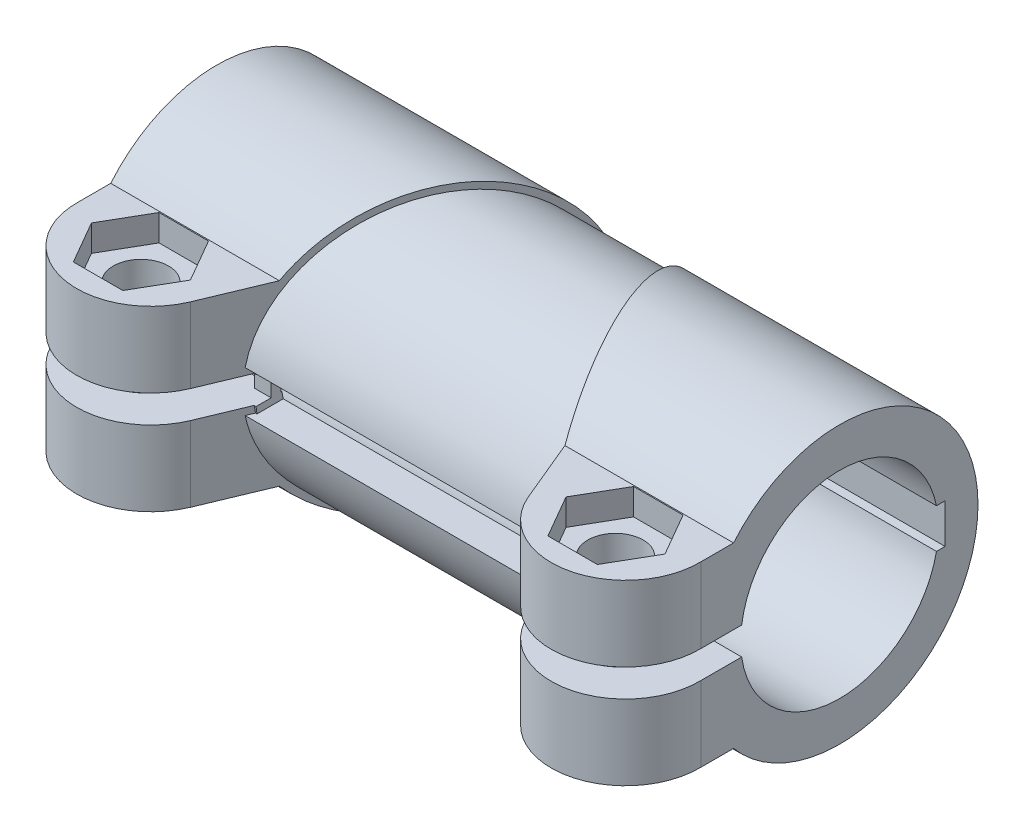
ISO-10303-21;
HEADER;
FILE_DESCRIPTION(('STEP AP214'),'2;1');
FILE_NAME('part.step','',(''),(''),'','','');
FILE_SCHEMA(('AUTOMOTIVE_DESIGN { 1 0 10303 214 1 1 1 1 }'));
ENDSEC;
DATA;
#1=APPLICATION_CONTEXT('core data for automotive mechanical design processes');
#2=APPLICATION_PROTOCOL_DEFINITION('international standard','automotive_design',2000,#1);
#3=PRODUCT_CONTEXT('',#1,'mechanical');
#4=PRODUCT('Part','Part','',(#3));
#5=PRODUCT_RELATED_PRODUCT_CATEGORY('part','',(#4));
#6=PRODUCT_DEFINITION_FORMATION('','',#4);
#7=PRODUCT_DEFINITION_CONTEXT('part definition',#1,'design');
#8=PRODUCT_DEFINITION('design','',#6,#7);
#9=PRODUCT_DEFINITION_SHAPE('','',#8);
#10=(LENGTH_UNIT() NAMED_UNIT(*) SI_UNIT(.MILLI.,.METRE.));
#11=(NAMED_UNIT(*) PLANE_ANGLE_UNIT() SI_UNIT($,.RADIAN.));
#12=(NAMED_UNIT(*) SI_UNIT($,.STERADIAN.) SOLID_ANGLE_UNIT());
#13=UNCERTAINTY_MEASURE_WITH_UNIT(LENGTH_MEASURE(1.E-05),#10,'distance_accuracy_value','');
#14=(GEOMETRIC_REPRESENTATION_CONTEXT(3) GLOBAL_UNCERTAINTY_ASSIGNED_CONTEXT((#13)) GLOBAL_UNIT_ASSIGNED_CONTEXT((#10,
#11,#12)) REPRESENTATION_CONTEXT('',''));
#15=CARTESIAN_POINT('',(0.,0.,0.));
#16=DIRECTION('',(0.,0.,1.));
#17=DIRECTION('',(1.,0.,0.));
#18=AXIS2_PLACEMENT_3D('',#15,#16,#17);
#19=CARTESIAN_POINT('',(36.0027781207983,13.5,21.2500000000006));
#20=DIRECTION('',(0.,-1.,0.));
#21=DIRECTION('',(0.999753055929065,0.,-0.022222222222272));
#22=AXIS2_PLACEMENT_3D('',#19,#20,#21);
#23=CYLINDRICAL_SURFACE('',#22,11.2499999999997);
#24=DIRECTION('',(0.,-1.,0.));
#25=VECTOR('',#24,1.);
#26=CARTESIAN_POINT('',(47.25,-2.09999999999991,21.));
#27=LINE('',#26,#25);
#28=CARTESIAN_POINT('',(47.25,-2.09999999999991,21.));
#29=VERTEX_POINT('',#28);
#30=CARTESIAN_POINT('',(47.25,-13.5,21.));
#31=VERTEX_POINT('',#30);
#32=EDGE_CURVE('E452',#29,#31,#27,.T.);
#33=ORIENTED_EDGE('',*,*,#32,.F.);
#34=CARTESIAN_POINT('',(36.0027781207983,-2.09999999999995,21.2500000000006));
#35=DIRECTION('',(0.,1.,0.));
#36=DIRECTION('',(-0.923076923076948,0.,0.384615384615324));
#37=AXIS2_PLACEMENT_3D('',#34,#35,#36);
#38=CIRCLE('',#37,11.2499999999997);
#39=CARTESIAN_POINT('',(25.6181627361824,-2.1,25.5769230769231));
#40=VERTEX_POINT('',#39);
#41=EDGE_CURVE('E1378',#40,#29,#38,.T.);
#42=ORIENTED_EDGE('',*,*,#41,.F.);
#43=DIRECTION('',(0.,1.,0.));
#44=VECTOR('',#43,1.);
#45=CARTESIAN_POINT('',(25.6181627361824,-13.5,25.5769230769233));
#46=LINE('',#45,#44);
#47=CARTESIAN_POINT('',(25.6181627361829,-13.5,25.5769230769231));
#48=VERTEX_POINT('',#47);
#49=EDGE_CURVE('E799',#40,#48,#46,.F.);
#50=ORIENTED_EDGE('',*,*,#49,.T.);
#51=CARTESIAN_POINT('',(36.0027781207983,-13.5,21.2500000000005));
#52=DIRECTION('',(0.,-1.,0.));
#53=DIRECTION('',(0.999753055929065,0.,-0.0222222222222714));
#54=AXIS2_PLACEMENT_3D('',#51,#52,#53);
#55=CIRCLE('',#54,11.2499999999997);
#56=EDGE_CURVE('E645',#48,#31,#55,.F.);
#57=ORIENTED_EDGE('',*,*,#56,.T.);
#58=EDGE_LOOP('',(#33,#42,#50,#57));
#59=FACE_BOUND('',#58,.T.);
#60=ADVANCED_FACE('F14',(#59),#23,.T.);
#61=CARTESIAN_POINT('',(36.0027781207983,2.10000000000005,21.2500000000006));
#62=DIRECTION('',(0.,-1.,0.));
#63=DIRECTION('',(0.999753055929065,0.,0.0222222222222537));
#64=AXIS2_PLACEMENT_3D('',#61,#62,#63);
#65=CIRCLE('',#64,11.2499999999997);
#66=CARTESIAN_POINT('',(47.25,2.10000000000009,21.));
#67=VERTEX_POINT('',#66);
#68=CARTESIAN_POINT('',(25.6181627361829,2.1,25.5769230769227));
#69=VERTEX_POINT('',#68);
#70=EDGE_CURVE('E839',#67,#69,#65,.T.);
#71=ORIENTED_EDGE('',*,*,#70,.F.);
#72=DIRECTION('',(0.,-1.,0.));
#73=VECTOR('',#72,1.);
#74=CARTESIAN_POINT('',(47.25,13.5,21.));
#75=LINE('',#74,#73);
#76=CARTESIAN_POINT('',(47.25,13.5,21.));
#77=VERTEX_POINT('',#76);
#78=EDGE_CURVE('E736',#77,#67,#75,.T.);
#79=ORIENTED_EDGE('',*,*,#78,.F.);
#80=CARTESIAN_POINT('',(36.0027781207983,13.5,21.2500000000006));
#81=DIRECTION('',(0.,1.,0.));
#82=DIRECTION('',(-0.923076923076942,0.,0.38461538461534));
#83=AXIS2_PLACEMENT_3D('',#80,#81,#82);
#84=CIRCLE('',#83,11.2499999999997);
#85=CARTESIAN_POINT('',(25.6181627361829,13.5,25.5769230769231));
#86=VERTEX_POINT('',#85);
#87=EDGE_CURVE('E541',#86,#77,#84,.T.);
#88=ORIENTED_EDGE('',*,*,#87,.F.);
#89=DIRECTION('',(0.,1.,0.));
#90=VECTOR('',#89,1.);
#91=CARTESIAN_POINT('',(25.6181627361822,2.1,25.5769230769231));
#92=LINE('',#91,#90);
#93=EDGE_CURVE('E852',#86,#69,#92,.F.);
#94=ORIENTED_EDGE('',*,*,#93,.T.);
#95=EDGE_LOOP('',(#71,#79,#88,#94));
#96=FACE_BOUND('',#95,.T.);
#97=ADVANCED_FACE('F836',(#96),#23,.T.);
#98=CARTESIAN_POINT('',(-36.0027781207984,13.4999999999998,21.2500000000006));
#99=DIRECTION('',(0.,-1.,0.));
#100=DIRECTION('',(0.923076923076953,0.,0.384615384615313));
#101=AXIS2_PLACEMENT_3D('',#98,#99,#100);
#102=CYLINDRICAL_SURFACE('',#101,11.2499999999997);
#103=CARTESIAN_POINT('',(-36.0027781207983,-2.1000000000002,21.2500000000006));
#104=DIRECTION('',(0.,1.,0.));
#105=DIRECTION('',(-0.999753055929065,0.,0.0222222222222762));
#106=AXIS2_PLACEMENT_3D('',#103,#104,#105);
#107=CIRCLE('',#106,11.2499999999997);
#108=CARTESIAN_POINT('',(-47.25,-2.10000000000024,21.));
#109=VERTEX_POINT('',#108);
#110=CARTESIAN_POINT('',(-25.6181627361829,-2.10000000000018,25.5769230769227));
#111=VERTEX_POINT('',#110);
#112=EDGE_CURVE('E431',#109,#111,#107,.T.);
#113=ORIENTED_EDGE('',*,*,#112,.F.);
#114=DIRECTION('',(0.,1.,0.));
#115=VECTOR('',#114,1.);
#116=CARTESIAN_POINT('',(-47.25,-13.5000000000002,21.));
#117=LINE('',#116,#115);
#118=CARTESIAN_POINT('',(-47.25,-13.5000000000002,21.));
#119=VERTEX_POINT('',#118);
#120=EDGE_CURVE('E434',#109,#119,#117,.F.);
#121=ORIENTED_EDGE('',*,*,#120,.T.);
#122=CARTESIAN_POINT('',(-36.0027781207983,-13.5000000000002,21.2500000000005));
#123=DIRECTION('',(0.,-1.,0.));
#124=DIRECTION('',(0.923076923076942,0.,0.384615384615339));
#125=AXIS2_PLACEMENT_3D('',#122,#123,#124);
#126=CIRCLE('',#125,11.2499999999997);
#127=CARTESIAN_POINT('',(-25.6181627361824,-13.5000000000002,25.5769230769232));
#128=VERTEX_POINT('',#127);
#129=EDGE_CURVE('E687',#119,#128,#126,.F.);
#130=ORIENTED_EDGE('',*,*,#129,.T.);
#131=DIRECTION('',(0.,-1.,0.));
#132=VECTOR('',#131,1.);
#133=CARTESIAN_POINT('',(-25.6181627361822,-2.10000000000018,25.5769230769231));
#134=LINE('',#133,#132);
#135=EDGE_CURVE('E437',#111,#128,#134,.T.);
#136=ORIENTED_EDGE('',*,*,#135,.F.);
#137=EDGE_LOOP('',(#113,#121,#130,#136));
#138=FACE_BOUND('',#137,.T.);
#139=ADVANCED_FACE('F433',(#138),#102,.T.);
#140=DIRECTION('',(0.,1.,0.));
#141=VECTOR('',#140,1.);
#142=CARTESIAN_POINT('',(-47.25,2.09999999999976,21.));
#143=LINE('',#142,#141);
#144=CARTESIAN_POINT('',(-47.25,13.4999999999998,21.));
#145=VERTEX_POINT('',#144);
#146=CARTESIAN_POINT('',(-47.25,2.09999999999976,21.));
#147=VERTEX_POINT('',#146);
#148=EDGE_CURVE('E725',#145,#147,#143,.F.);
#149=ORIENTED_EDGE('',*,*,#148,.T.);
#150=CARTESIAN_POINT('',(-36.0027781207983,2.0999999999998,21.2500000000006));
#151=DIRECTION('',(0.,-1.,0.));
#152=DIRECTION('',(0.923076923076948,0.,0.384615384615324));
#153=AXIS2_PLACEMENT_3D('',#150,#151,#152);
#154=CIRCLE('',#153,11.2499999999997);
#155=CARTESIAN_POINT('',(-25.6181627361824,2.09999999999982,25.5769230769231));
#156=VERTEX_POINT('',#155);
#157=EDGE_CURVE('E505',#156,#147,#154,.T.);
#158=ORIENTED_EDGE('',*,*,#157,.F.);
#159=DIRECTION('',(0.,-1.,0.));
#160=VECTOR('',#159,1.);
#161=CARTESIAN_POINT('',(-25.6181627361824,13.4999999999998,25.5769230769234));
#162=LINE('',#161,#160);
#163=CARTESIAN_POINT('',(-25.6181627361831,13.4999999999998,25.5769230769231));
#164=VERTEX_POINT('',#163);
#165=EDGE_CURVE('E810',#164,#156,#162,.T.);
#166=ORIENTED_EDGE('',*,*,#165,.F.);
#167=CARTESIAN_POINT('',(-36.0027781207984,13.4999999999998,21.2500000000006));
#168=DIRECTION('',(0.,1.,0.));
#169=DIRECTION('',(-0.999753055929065,0.,-0.0222222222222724));
#170=AXIS2_PLACEMENT_3D('',#167,#168,#169);
#171=CIRCLE('',#170,11.2499999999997);
#172=EDGE_CURVE('E590',#145,#164,#171,.T.);
#173=ORIENTED_EDGE('',*,*,#172,.F.);
#174=EDGE_LOOP('',(#149,#158,#166,#173));
#175=FACE_BOUND('',#174,.T.);
#176=ADVANCED_FACE('F809',(#175),#102,.T.);
#177=CARTESIAN_POINT('',(73.6510973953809,3.15,18.6356513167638));
#178=DIRECTION('',(0.,1.,0.));
#179=DIRECTION('',(0.,0.,1.));
#180=AXIS2_PLACEMENT_3D('',#177,#178,#179);
#181=PLANE('',#180);
#182=DIRECTION('',(-1.,0.,0.));
#183=VECTOR('',#182,1.);
#184=CARTESIAN_POINT('',(73.6510973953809,3.15,19.7503797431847));
#185=LINE('',#184,#183);
#186=CARTESIAN_POINT('',(23.1904363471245,3.15,19.7503797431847));
#187=VERTEX_POINT('',#186);
#188=CARTESIAN_POINT('',(-23.1904363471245,3.15,19.7503797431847));
#189=VERTEX_POINT('',#188);
#190=EDGE_CURVE('E1254',#187,#189,#185,.T.);
#191=ORIENTED_EDGE('',*,*,#190,.T.);
#192=DIRECTION('',(-0.384615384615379,0.,0.923076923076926));
#193=VECTOR('',#192,1.);
#194=CARTESIAN_POINT('',(-30.2592696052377,3.15,36.7155795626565));
#195=LINE('',#194,#193);
#196=CARTESIAN_POINT('',(-22.7259661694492,3.15,18.6356513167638));
#197=VERTEX_POINT('',#196);
#198=EDGE_CURVE('E1469',#197,#189,#195,.T.);
#199=ORIENTED_EDGE('',*,*,#198,.F.);
#200=DIRECTION('',(1.,0.,0.));
#201=VECTOR('',#200,1.);
#202=CARTESIAN_POINT('',(-73.6510973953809,3.15,18.6356513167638));
#203=LINE('',#202,#201);
#204=CARTESIAN_POINT('',(-22.5,3.15,18.6356513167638));
#205=VERTEX_POINT('',#204);
#206=EDGE_CURVE('E33',#197,#205,#203,.T.);
#207=ORIENTED_EDGE('',*,*,#206,.T.);
#208=DIRECTION('',(0.,0.,-1.));
#209=VECTOR('',#208,1.);
#210=CARTESIAN_POINT('',(-22.5,3.14999999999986,18.6356513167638));
#211=LINE('',#210,#209);
#212=CARTESIAN_POINT('',(-22.5,3.14999999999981,14.6655207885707));
#213=VERTEX_POINT('',#212);
#214=EDGE_CURVE('E955',#213,#205,#211,.F.);
#215=ORIENTED_EDGE('',*,*,#214,.F.);
#216=DIRECTION('',(-1.,0.,0.));
#217=VECTOR('',#216,1.);
#218=CARTESIAN_POINT('',(22.5,3.15,14.6655207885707));
#219=LINE('',#218,#217);
#220=CARTESIAN_POINT('',(22.5,3.15,14.6655207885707));
#221=VERTEX_POINT('',#220);
#222=EDGE_CURVE('E945',#221,#213,#219,.T.);
#223=ORIENTED_EDGE('',*,*,#222,.F.);
#224=DIRECTION('',(0.,0.,1.));
#225=VECTOR('',#224,1.);
#226=CARTESIAN_POINT('',(22.5,3.15,14.6655207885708));
#227=LINE('',#226,#225);
#228=CARTESIAN_POINT('',(22.5,3.15,18.6356513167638));
#229=VERTEX_POINT('',#228);
#230=EDGE_CURVE('E959',#221,#229,#227,.T.);
#231=ORIENTED_EDGE('',*,*,#230,.T.);
#232=DIRECTION('',(-1.,0.,0.));
#233=VECTOR('',#232,1.);
#234=CARTESIAN_POINT('',(73.6510973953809,3.15,18.6356513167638));
#235=LINE('',#234,#233);
#236=CARTESIAN_POINT('',(22.7259786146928,3.15000086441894,18.6356512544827));
#237=VERTEX_POINT('',#236);
#238=EDGE_CURVE('E41',#237,#229,#235,.T.);
#239=ORIENTED_EDGE('',*,*,#238,.F.);
#240=DIRECTION('',(0.384615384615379,0.,0.923076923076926));
#241=VECTOR('',#240,1.);
#242=CARTESIAN_POINT('',(30.2592696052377,3.15,36.7155795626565));
#243=LINE('',#242,#241);
#244=EDGE_CURVE('E1260',#237,#187,#243,.T.);
#245=ORIENTED_EDGE('',*,*,#244,.T.);
#246=EDGE_LOOP('',(#191,#199,#207,#215,#223,#231,#239,#245));
#247=FACE_BOUND('',#246,.T.);
#248=ADVANCED_FACE('F1576',(#247),#181,.F.);
#249=CARTESIAN_POINT('',(73.6510973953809,0.,0.));
#250=DIRECTION('',(-1.,0.,0.));
#251=DIRECTION('',(0.,0.,1.));
#252=AXIS2_PLACEMENT_3D('',#249,#250,#251);
#253=CYLINDRICAL_SURFACE('',#252,20.);
#254=CARTESIAN_POINT('',(-14.9611114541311,0.,0.));
#255=DIRECTION('',(-0.923076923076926,0.,-0.384615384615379));
#256=DIRECTION('',(0.384615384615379,0.,-0.923076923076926));
#257=AXIS2_PLACEMENT_3D('',#254,#255,#256);
#258=ELLIPSE('',#257,21.6666666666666,20.);
#259=CARTESIAN_POINT('',(-23.1904363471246,-3.15,19.7503797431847));
#260=VERTEX_POINT('',#259);
#261=EDGE_CURVE('E1247',#189,#260,#258,.T.);
#262=ORIENTED_EDGE('',*,*,#261,.F.);
#263=ORIENTED_EDGE('',*,*,#190,.F.);
#264=CARTESIAN_POINT('',(14.9611114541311,0.,0.));
#265=DIRECTION('',(-0.923076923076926,0.,0.384615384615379));
#266=DIRECTION('',(-0.384615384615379,0.,-0.923076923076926));
#267=AXIS2_PLACEMENT_3D('',#264,#265,#266);
#268=ELLIPSE('',#267,21.6666666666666,20.);
#269=CARTESIAN_POINT('',(23.1904363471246,-3.15,19.7503797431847));
#270=VERTEX_POINT('',#269);
#271=EDGE_CURVE('E25',#187,#270,#268,.T.);
#272=ORIENTED_EDGE('',*,*,#271,.T.);
#273=DIRECTION('',(-1.,0.,0.));
#274=VECTOR('',#273,1.);
#275=CARTESIAN_POINT('',(73.6510973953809,-3.15,19.7503797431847));
#276=LINE('',#275,#274);
#277=EDGE_CURVE('E1263',#270,#260,#276,.T.);
#278=ORIENTED_EDGE('',*,*,#277,.T.);
#279=EDGE_LOOP('',(#262,#263,#272,#278));
#280=FACE_BOUND('',#279,.T.);
#281=ADVANCED_FACE('F1582',(#280),#253,.T.);
#282=CARTESIAN_POINT('',(73.6510973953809,-3.15,19.7503797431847));
#283=DIRECTION('',(0.,-1.,0.));
#284=DIRECTION('',(0.,0.,-1.));
#285=AXIS2_PLACEMENT_3D('',#282,#283,#284);
#286=PLANE('',#285);
#287=DIRECTION('',(0.384615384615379,0.,-0.923076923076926));
#288=VECTOR('',#287,1.);
#289=CARTESIAN_POINT('',(-30.6550311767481,-3.15000000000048,37.6654073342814));
#290=LINE('',#289,#288);
#291=CARTESIAN_POINT('',(-22.7259786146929,-3.15000086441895,18.6356512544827));
#292=VERTEX_POINT('',#291);
#293=EDGE_CURVE('E1461',#260,#292,#290,.T.);
#294=ORIENTED_EDGE('',*,*,#293,.F.);
#295=ORIENTED_EDGE('',*,*,#277,.F.);
#296=DIRECTION('',(-0.384615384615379,0.,-0.923076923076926));
#297=VECTOR('',#296,1.);
#298=CARTESIAN_POINT('',(30.6550311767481,-3.15000000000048,37.6654073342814));
#299=LINE('',#298,#297);
#300=CARTESIAN_POINT('',(22.7259661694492,-3.15,18.6356513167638));
#301=VERTEX_POINT('',#300);
#302=EDGE_CURVE('E9',#270,#301,#299,.T.);
#303=ORIENTED_EDGE('',*,*,#302,.T.);
#304=DIRECTION('',(-1.,0.,0.));
#305=VECTOR('',#304,1.);
#306=CARTESIAN_POINT('',(73.6510973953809,-3.15,18.6356513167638));
#307=LINE('',#306,#305);
#308=CARTESIAN_POINT('',(22.5,-3.15,18.6356513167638));
#309=VERTEX_POINT('',#308);
#310=EDGE_CURVE('E1265',#301,#309,#307,.T.);
#311=ORIENTED_EDGE('',*,*,#310,.T.);
#312=DIRECTION('',(0.,0.,-1.));
#313=VECTOR('',#312,1.);
#314=CARTESIAN_POINT('',(22.5,-3.15,18.6356513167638));
#315=LINE('',#314,#313);
#316=CARTESIAN_POINT('',(22.5,-3.1499999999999,14.6655207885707));
#317=VERTEX_POINT('',#316);
#318=EDGE_CURVE('E964',#309,#317,#315,.T.);
#319=ORIENTED_EDGE('',*,*,#318,.T.);
#320=DIRECTION('',(1.,0.,0.));
#321=VECTOR('',#320,1.);
#322=CARTESIAN_POINT('',(-22.5,-3.15000000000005,14.6655207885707));
#323=LINE('',#322,#321);
#324=CARTESIAN_POINT('',(-22.5,-3.15000000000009,14.6655207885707));
#325=VERTEX_POINT('',#324);
#326=EDGE_CURVE('E928',#317,#325,#323,.F.);
#327=ORIENTED_EDGE('',*,*,#326,.T.);
#328=DIRECTION('',(0.,0.,1.));
#329=VECTOR('',#328,1.);
#330=CARTESIAN_POINT('',(-22.5,-3.15000000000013,14.6655207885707));
#331=LINE('',#330,#329);
#332=CARTESIAN_POINT('',(-22.5,-3.15,18.6356513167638));
#333=VERTEX_POINT('',#332);
#334=EDGE_CURVE('E968',#333,#325,#331,.F.);
#335=ORIENTED_EDGE('',*,*,#334,.F.);
#336=DIRECTION('',(1.,0.,0.));
#337=VECTOR('',#336,1.);
#338=CARTESIAN_POINT('',(-73.6510973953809,-3.15,18.6356513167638));
#339=LINE('',#338,#337);
#340=EDGE_CURVE('E1460',#292,#333,#339,.T.);
#341=ORIENTED_EDGE('',*,*,#340,.F.);
#342=EDGE_LOOP('',(#294,#295,#303,#311,#319,#327,#335,#341));
#343=FACE_BOUND('',#342,.T.);
#344=ADVANCED_FACE('F16',(#343),#286,.F.);
#345=CARTESIAN_POINT('',(7.08611145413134,-21.112046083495,-18.9));
#346=DIRECTION('',(-0.923076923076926,0.,0.384615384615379));
#347=DIRECTION('',(0.384615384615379,0.,0.923076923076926));
#348=AXIS2_PLACEMENT_3D('',#345,#346,#347);
#349=PLANE('',#348);
#350=ORIENTED_EDGE('',*,*,#302,.F.);
#351=ORIENTED_EDGE('',*,*,#271,.F.);
#352=ORIENTED_EDGE('',*,*,#244,.F.);
#353=CARTESIAN_POINT('',(7.08611145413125,1.2490009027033E-13,-18.9));
#354=CARTESIAN_POINT('',(7.08611145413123,4.75127128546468,-18.9));
#355=CARTESIAN_POINT('',(7.83174563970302,9.32824313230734,-17.1104779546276));
#356=CARTESIAN_POINT('',(9.90599045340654,14.7212795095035,-12.132290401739));
#357=CARTESIAN_POINT('',(10.7958467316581,16.2553148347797,-9.99663533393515));
#358=CARTESIAN_POINT('',(12.4368579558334,17.9796810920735,-6.05820839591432));
#359=CARTESIAN_POINT('',(13.0958885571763,18.4340680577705,-4.47653495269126));
#360=CARTESIAN_POINT('',(14.4300367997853,18.9269119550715,-1.27457917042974));
#361=CARTESIAN_POINT('',(15.1051544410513,18.9653688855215,0.345703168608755));
#362=CARTESIAN_POINT('',(17.104277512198,18.4690319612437,5.14359853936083));
#363=CARTESIAN_POINT('',(18.4020530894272,17.3225303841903,8.25825992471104));
#364=CARTESIAN_POINT('',(20.657999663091,13.4651344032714,13.6725317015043));
#365=CARTESIAN_POINT('',(21.5509713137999,10.8653457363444,15.8156636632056));
#366=CARTESIAN_POINT('',(22.470956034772,6.03034178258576,18.0236269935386));
#367=CARTESIAN_POINT('',(22.6946852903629,4.08914771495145,18.5605772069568));
#368=CARTESIAN_POINT('',(22.7873492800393,2.1000010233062,18.78297078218));
#369=B_SPLINE_CURVE_WITH_KNOTS('',3,(#353,#354,#355,#356,#357,#358,#359,#360,#361,#362,#363,
#364,#365,#366,#367,#368),.UNSPECIFIED.,.F.,.F.,(4,2,2,2,2,2,2,4),(0.,0.248943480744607,
0.384550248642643,0.469970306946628,0.555390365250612,0.726230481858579,0.896908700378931,1.),.UNSPECIFIED.);
#370=CARTESIAN_POINT('',(22.7873492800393,2.1,18.7829707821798));
#371=VERTEX_POINT('',#370);
#372=EDGE_CURVE('E855',#237,#371,#369,.T.);
#373=ORIENTED_EDGE('',*,*,#372,.T.);
#374=DIRECTION('',(-0.384615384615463,0.,-0.923076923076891));
#375=VECTOR('',#374,1.);
#376=CARTESIAN_POINT('',(25.6181627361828,2.1,25.5769230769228));
#377=LINE('',#376,#375);
#378=EDGE_CURVE('E854',#371,#69,#377,.F.);
#379=ORIENTED_EDGE('',*,*,#378,.T.);
#380=ORIENTED_EDGE('',*,*,#93,.F.);
#381=DIRECTION('',(0.384615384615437,0.,0.923076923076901));
#382=VECTOR('',#381,1.);
#383=CARTESIAN_POINT('',(21.6634897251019,13.5,16.0857078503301));
#384=LINE('',#383,#382);
#385=CARTESIAN_POINT('',(21.6634897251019,13.5,16.0857078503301));
#386=VERTEX_POINT('',#385);
#387=EDGE_CURVE('E536',#386,#86,#384,.T.);
#388=ORIENTED_EDGE('',*,*,#387,.F.);
#389=CARTESIAN_POINT('',(21.6634897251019,13.5000000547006,16.0857078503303));
#390=CARTESIAN_POINT('',(21.1833788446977,14.8729641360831,14.9334417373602));
#391=CARTESIAN_POINT('',(20.6381577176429,16.0775206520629,13.6249110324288));
#392=CARTESIAN_POINT('',(19.1307382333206,18.6550257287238,10.0071042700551));
#393=CARTESIAN_POINT('',(18.1032099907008,19.7865387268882,7.54103648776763));
#394=CARTESIAN_POINT('',(16.0771911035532,20.9535599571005,2.67859115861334));
#395=CARTESIAN_POINT('',(15.1263265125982,21.1176302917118,0.396516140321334));
#396=CARTESIAN_POINT('',(13.2510058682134,20.7189661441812,-4.10425340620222));
#397=CARTESIAN_POINT('',(12.3265498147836,20.1562316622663,-6.32294793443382));
#398=CARTESIAN_POINT('',(10.3330395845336,18.0614612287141,-11.1073724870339));
#399=CARTESIAN_POINT('',(9.34431037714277,16.3569775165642,-13.480322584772));
#400=CARTESIAN_POINT('',(7.94812558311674,12.7268971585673,-16.8311660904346));
#401=CARTESIAN_POINT('',(7.46106367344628,11.0117181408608,-18.0001146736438));
#402=CARTESIAN_POINT('',(7.08611164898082,9.15368874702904,-18.8999995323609));
#403=B_SPLINE_CURVE_WITH_KNOTS('',3,(#389,#390,#391,#392,#393,#394,#395,#396,#397,#398,#399,
#400,#401,#402),.UNSPECIFIED.,.F.,.F.,(4,2,2,2,2,2,4),(0.,0.126982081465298,0.319089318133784,
0.48133693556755,0.643584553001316,0.851056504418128,1.),.UNSPECIFIED.);
#404=CARTESIAN_POINT('',(7.08611164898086,9.15368874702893,-18.899999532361));
#405=VERTEX_POINT('',#404);
#406=EDGE_CURVE('E848',#386,#405,#403,.T.);
#407=ORIENTED_EDGE('',*,*,#406,.T.);
#408=CARTESIAN_POINT('',(14.9611114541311,0.,0.));
#409=DIRECTION('',(-0.923076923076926,0.,0.384615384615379));
#410=DIRECTION('',(0.384615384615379,0.,0.923076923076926));
#411=AXIS2_PLACEMENT_3D('',#408,#409,#410);
#412=ELLIPSE('',#411,22.750001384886,21.0000012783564);
#413=CARTESIAN_POINT('',(7.0861114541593,-9.15368778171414,-18.8999999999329));
#414=VERTEX_POINT('',#413);
#415=EDGE_CURVE('E1470',#414,#405,#412,.F.);
#416=ORIENTED_EDGE('',*,*,#415,.F.);
#417=CARTESIAN_POINT('',(7.08611145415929,-9.15368778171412,-18.8999999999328));
#418=CARTESIAN_POINT('',(7.72694749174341,-12.3292736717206,-17.3619935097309));
#419=CARTESIAN_POINT('',(8.68965866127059,-15.0611574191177,-15.0514867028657));
#420=CARTESIAN_POINT('',(10.8468931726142,-18.7497675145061,-9.87412387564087));
#421=CARTESIAN_POINT('',(11.946703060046,-19.9303075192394,-7.23458014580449));
#422=CARTESIAN_POINT('',(14.0334835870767,-20.996752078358,-2.22630688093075));
#423=CARTESIAN_POINT('',(14.9469129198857,-21.112046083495,-0.0340764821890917));
#424=CARTESIAN_POINT('',(16.7458436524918,-20.6730439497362,4.28335727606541));
#425=CARTESIAN_POINT('',(17.6313450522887,-20.1187478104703,6.40856063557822));
#426=CARTESIAN_POINT('',(19.5891834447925,-18.0614610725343,11.1073727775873));
#427=CARTESIAN_POINT('',(20.5779126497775,-16.3569773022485,13.4803228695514));
#428=CARTESIAN_POINT('',(21.4838535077,-14.0015310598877,15.6545809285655));
#429=CARTESIAN_POINT('',(21.574811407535,-13.7535917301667,15.8728798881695));
#430=CARTESIAN_POINT('',(21.6634896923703,-13.5000001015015,16.0857077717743));
#431=B_SPLINE_CURVE_WITH_KNOTS('',3,(#417,#418,#419,#420,#421,#422,#423,#424,#425,#426,#427,
#428,#429,#430),.UNSPECIFIED.,.F.,.F.,(4,2,2,2,2,2,4),(0.,0.255287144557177,0.461124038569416,
0.615707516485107,0.770290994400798,0.976365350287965,1.),.UNSPECIFIED.);
#432=CARTESIAN_POINT('',(21.6634896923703,-13.5,16.0857077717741));
#433=VERTEX_POINT('',#432);
#434=EDGE_CURVE('E858',#414,#433,#431,.T.);
#435=ORIENTED_EDGE('',*,*,#434,.T.);
#436=DIRECTION('',(-0.384615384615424,0.,-0.923076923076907));
#437=VECTOR('',#436,1.);
#438=CARTESIAN_POINT('',(25.6181627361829,-13.5,25.5769230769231));
#439=LINE('',#438,#437);
#440=EDGE_CURVE('E630',#433,#48,#439,.F.);
#441=ORIENTED_EDGE('',*,*,#440,.T.);
#442=ORIENTED_EDGE('',*,*,#49,.F.);
#443=DIRECTION('',(0.384615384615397,0.,0.923076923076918));
#444=VECTOR('',#443,1.);
#445=CARTESIAN_POINT('',(22.7873492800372,-2.1,18.7829707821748));
#446=LINE('',#445,#444);
#447=CARTESIAN_POINT('',(22.7873492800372,-2.1,18.7829707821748));
#448=VERTEX_POINT('',#447);
#449=EDGE_CURVE('E1373',#40,#448,#446,.F.);
#450=ORIENTED_EDGE('',*,*,#449,.T.);
#451=CARTESIAN_POINT('',(22.7873492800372,-2.10000102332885,18.7829707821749));
#452=CARTESIAN_POINT('',(22.6008447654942,-6.10355018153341,18.3353599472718));
#453=CARTESIAN_POINT('',(21.8862081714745,-9.85934216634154,16.6202321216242));
#454=CARTESIAN_POINT('',(20.0162324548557,-14.7212791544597,12.1322904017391));
#455=CARTESIAN_POINT('',(19.1263761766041,-16.2553145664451,9.99663533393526));
#456=CARTESIAN_POINT('',(17.4853649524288,-17.9796809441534,6.05820839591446));
#457=CARTESIAN_POINT('',(16.8263343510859,-18.4340679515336,4.47653495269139));
#458=CARTESIAN_POINT('',(15.492186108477,-18.9269119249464,1.27457917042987));
#459=CARTESIAN_POINT('',(14.8170684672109,-18.9653688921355,-0.345703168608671));
#460=CARTESIAN_POINT('',(12.8179453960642,-18.469032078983,-5.14359853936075));
#461=CARTESIAN_POINT('',(11.520169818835,-17.3225305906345,-8.25825992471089));
#462=CARTESIAN_POINT('',(9.55032601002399,-13.9543359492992,-12.9858850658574));
#463=CARTESIAN_POINT('',(8.83421025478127,-12.13096245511,-14.70456287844));
#464=CARTESIAN_POINT('',(7.50253544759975,-7.02262139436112,-17.9005824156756));
#465=CARTESIAN_POINT('',(7.08611145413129,-3.55127136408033,-18.8999999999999));
#466=CARTESIAN_POINT('',(7.08611145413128,1.2490009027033E-13,-18.8999999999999));
#467=B_SPLINE_CURVE_WITH_KNOTS('',3,(#451,#452,#453,#454,#455,#456,#457,#458,#459,#460,#461,
#462,#463,#464,#465,#466),.UNSPECIFIED.,.F.,.F.,(4,2,2,2,2,2,2,4),(0.,0.211660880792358,
0.347645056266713,0.433302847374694,0.518960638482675,0.690276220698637,0.817997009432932,1.),.UNSPECIFIED.);
#468=EDGE_CURVE('E871',#448,#301,#467,.T.);
#469=ORIENTED_EDGE('',*,*,#468,.T.);
#470=EDGE_LOOP('',(#350,#351,#352,#373,#379,#380,#388,#407,#416,#435,#441,#442,#450,#469));
#471=FACE_BOUND('',#470,.T.);
#472=ADVANCED_FACE('F768',(#471),#349,.T.);
#473=CARTESIAN_POINT('',(-23.,0.,0.));
#474=DIRECTION('',(-1.,0.,0.));
#475=DIRECTION('',(0.,0.,-1.));
#476=AXIS2_PLACEMENT_3D('',#473,#474,#475);
#477=CYLINDRICAL_SURFACE('',#476,18.9);
#478=ORIENTED_EDGE('',*,*,#238,.T.);
#479=CARTESIAN_POINT('',(22.5,0.,0.));
#480=DIRECTION('',(1.,0.,0.));
#481=DIRECTION('',(0.,0.166666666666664,0.986013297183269));
#482=AXIS2_PLACEMENT_3D('',#479,#480,#481);
#483=CIRCLE('',#482,18.9);
#484=CARTESIAN_POINT('',(22.5,2.1,18.7829710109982));
#485=VERTEX_POINT('',#484);
#486=EDGE_CURVE('E913',#229,#485,#483,.T.);
#487=ORIENTED_EDGE('',*,*,#486,.T.);
#488=DIRECTION('',(-0.999999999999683,0.,7.96307696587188E-07));
#489=VECTOR('',#488,1.);
#490=CARTESIAN_POINT('',(22.7873492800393,2.1,18.7829707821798));
#491=LINE('',#490,#489);
#492=EDGE_CURVE('E1293',#371,#485,#491,.T.);
#493=ORIENTED_EDGE('',*,*,#492,.F.);
#494=ORIENTED_EDGE('',*,*,#372,.F.);
#495=EDGE_LOOP('',(#478,#487,#493,#494));
#496=FACE_BOUND('',#495,.T.);
#497=ADVANCED_FACE('F878',(#496),#477,.T.);
#498=ORIENTED_EDGE('',*,*,#310,.F.);
#499=ORIENTED_EDGE('',*,*,#468,.F.);
#500=DIRECTION('',(0.999999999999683,0.,-7.96325166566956E-07));
#501=VECTOR('',#500,1.);
#502=CARTESIAN_POINT('',(22.5,-2.1,18.7829710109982));
#503=LINE('',#502,#501);
#504=CARTESIAN_POINT('',(22.5,-2.1,18.7829710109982));
#505=VERTEX_POINT('',#504);
#506=EDGE_CURVE('E1369',#505,#448,#503,.T.);
#507=ORIENTED_EDGE('',*,*,#506,.F.);
#508=CARTESIAN_POINT('',(22.5,0.,0.));
#509=DIRECTION('',(1.,0.,0.));
#510=DIRECTION('',(0.,-0.111111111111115,0.993807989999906));
#511=AXIS2_PLACEMENT_3D('',#508,#509,#510);
#512=CIRCLE('',#511,18.9);
#513=EDGE_CURVE('E857',#505,#309,#512,.T.);
#514=ORIENTED_EDGE('',*,*,#513,.T.);
#515=EDGE_LOOP('',(#498,#499,#507,#514));
#516=FACE_BOUND('',#515,.T.);
#517=ADVANCED_FACE('F764',(#516),#477,.T.);
#518=CARTESIAN_POINT('',(-25.6181627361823,-21.1176302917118,25.5769230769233));
#519=DIRECTION('',(0.923076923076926,0.,0.384615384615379));
#520=DIRECTION('',(0.384615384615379,0.,-0.923076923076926));
#521=AXIS2_PLACEMENT_3D('',#518,#519,#520);
#522=PLANE('',#521);
#523=CARTESIAN_POINT('',(-21.663489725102,-13.5000000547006,16.0857078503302));
#524=CARTESIAN_POINT('',(-21.1833788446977,-14.8729641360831,14.9334417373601));
#525=CARTESIAN_POINT('',(-20.638157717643,-16.0775206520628,13.6249110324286));
#526=CARTESIAN_POINT('',(-19.1307382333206,-18.6550257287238,10.0071042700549));
#527=CARTESIAN_POINT('',(-18.1032099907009,-19.7865387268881,7.54103648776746));
#528=CARTESIAN_POINT('',(-16.0771911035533,-20.9535599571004,2.67859115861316));
#529=CARTESIAN_POINT('',(-15.1263265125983,-21.1176302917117,0.396516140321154));
#530=CARTESIAN_POINT('',(-13.2510058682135,-20.7189661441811,-4.1042534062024));
#531=CARTESIAN_POINT('',(-12.3265498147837,-20.1562316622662,-6.32294793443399));
#532=CARTESIAN_POINT('',(-10.3330395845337,-18.0614612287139,-11.107372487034));
#533=CARTESIAN_POINT('',(-9.34431037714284,-16.356977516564,-13.4803225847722));
#534=CARTESIAN_POINT('',(-7.94812558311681,-12.7268971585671,-16.8311660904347));
#535=CARTESIAN_POINT('',(-7.46106367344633,-11.0117181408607,-18.0001146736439));
#536=CARTESIAN_POINT('',(-7.08611164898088,-9.15368874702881,-18.899999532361));
#537=B_SPLINE_CURVE_WITH_KNOTS('',3,(#523,#524,#525,#526,#527,#528,#529,#530,#531,#532,#533,
#534,#535,#536),.UNSPECIFIED.,.F.,.F.,(4,2,2,2,2,2,4),(0.,0.1269820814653,0.319089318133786,
0.481336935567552,0.643584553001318,0.851056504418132,1.),.UNSPECIFIED.);
#538=CARTESIAN_POINT('',(-21.6634897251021,-13.5000000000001,16.08570785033));
#539=VERTEX_POINT('',#538);
#540=CARTESIAN_POINT('',(-7.08611164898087,-9.15368874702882,-18.899999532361));
#541=VERTEX_POINT('',#540);
#542=EDGE_CURVE('E1557',#539,#541,#537,.T.);
#543=ORIENTED_EDGE('',*,*,#542,.T.);
#544=CARTESIAN_POINT('',(-14.9611114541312,0.,0.));
#545=DIRECTION('',(0.923076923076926,0.,0.384615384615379));
#546=DIRECTION('',(-0.384615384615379,0.,0.923076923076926));
#547=AXIS2_PLACEMENT_3D('',#544,#545,#546);
#548=ELLIPSE('',#547,22.749999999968,20.9999999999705);
#549=CARTESIAN_POINT('',(-7.0861114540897,9.15368778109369,-18.9000000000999));
#550=VERTEX_POINT('',#549);
#551=EDGE_CURVE('E796',#550,#541,#548,.F.);
#552=ORIENTED_EDGE('',*,*,#551,.F.);
#553=CARTESIAN_POINT('',(-7.08611145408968,9.15368778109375,-18.9000000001));
#554=CARTESIAN_POINT('',(-7.7269474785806,12.3292737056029,-17.3619935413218));
#555=CARTESIAN_POINT('',(-8.68965863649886,15.0611574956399,-15.0514867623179));
#556=CARTESIAN_POINT('',(-10.8468933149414,18.7497679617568,-9.87412353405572));
#557=CARTESIAN_POINT('',(-11.9467034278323,19.930308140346,-7.23457926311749));
#558=CARTESIAN_POINT('',(-14.033484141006,20.9967524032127,-2.22630555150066));
#559=CARTESIAN_POINT('',(-14.9469133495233,21.1120462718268,-0.0340754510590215));
#560=CARTESIAN_POINT('',(-16.745843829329,20.6730440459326,4.2833577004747));
#561=CARTESIAN_POINT('',(-17.6313451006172,20.1187479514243,6.40856075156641));
#562=CARTESIAN_POINT('',(-19.5891833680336,18.061461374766,11.107372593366));
#563=CARTESIAN_POINT('',(-20.5779125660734,16.3569776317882,13.4803226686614));
#564=CARTESIAN_POINT('',(-21.4838534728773,14.0015312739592,15.6545808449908));
#565=CARTESIAN_POINT('',(-21.5748114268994,13.7535917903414,15.8728799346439));
#566=CARTESIAN_POINT('',(-21.6634897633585,13.4999999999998,16.0857079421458));
#567=B_SPLINE_CURVE_WITH_KNOTS('',3,(#553,#554,#555,#556,#557,#558,#559,#560,#561,#562,#563,
#564,#565,#566),.UNSPECIFIED.,.F.,.F.,(4,2,2,2,2,2,4),(0.,0.255287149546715,0.461124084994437,
0.615707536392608,0.770290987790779,0.976365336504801,1.),.UNSPECIFIED.);
#568=CARTESIAN_POINT('',(-21.6634897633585,13.4999999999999,16.0857079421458));
#569=VERTEX_POINT('',#568);
#570=EDGE_CURVE('E793',#550,#569,#567,.T.);
#571=ORIENTED_EDGE('',*,*,#570,.T.);
#572=DIRECTION('',(0.384615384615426,0.,-0.923076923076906));
#573=VECTOR('',#572,1.);
#574=CARTESIAN_POINT('',(-25.6181627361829,13.4999999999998,25.5769230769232));
#575=LINE('',#574,#573);
#576=EDGE_CURVE('E595',#164,#569,#575,.T.);
#577=ORIENTED_EDGE('',*,*,#576,.F.);
#578=ORIENTED_EDGE('',*,*,#165,.T.);
#579=DIRECTION('',(-0.384615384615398,0.,0.923076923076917));
#580=VECTOR('',#579,1.);
#581=CARTESIAN_POINT('',(-22.7873492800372,2.09999999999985,18.7829707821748));
#582=LINE('',#581,#580);
#583=CARTESIAN_POINT('',(-22.7873492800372,2.09999999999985,18.7829707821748));
#584=VERTEX_POINT('',#583);
#585=EDGE_CURVE('E500',#156,#584,#582,.F.);
#586=ORIENTED_EDGE('',*,*,#585,.T.);
#587=CARTESIAN_POINT('',(-22.7873492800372,2.10000102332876,18.7829707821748));
#588=CARTESIAN_POINT('',(-22.6008447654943,6.10355018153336,18.3353599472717));
#589=CARTESIAN_POINT('',(-21.8862081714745,9.85934216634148,16.6202321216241));
#590=CARTESIAN_POINT('',(-20.0162324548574,14.7212791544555,12.132290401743));
#591=CARTESIAN_POINT('',(-19.1263761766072,16.255314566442,9.99663533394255));
#592=CARTESIAN_POINT('',(-17.4853649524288,17.9796809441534,6.05820839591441));
#593=CARTESIAN_POINT('',(-16.8263343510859,18.4340679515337,4.4765349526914));
#594=CARTESIAN_POINT('',(-15.492186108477,18.9269119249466,1.27457917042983));
#595=CARTESIAN_POINT('',(-14.8170684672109,18.9653688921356,-0.345703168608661));
#596=CARTESIAN_POINT('',(-12.8179453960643,18.4690320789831,-5.14359853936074));
#597=CARTESIAN_POINT('',(-11.5201698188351,17.3225305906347,-8.25825992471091));
#598=CARTESIAN_POINT('',(-9.55032601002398,13.9543359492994,-12.9858850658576));
#599=CARTESIAN_POINT('',(-8.83421025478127,12.1309624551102,-14.7045628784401));
#600=CARTESIAN_POINT('',(-7.50253544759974,7.02262139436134,-17.9005824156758));
#601=CARTESIAN_POINT('',(-7.08611145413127,3.55127136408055,-18.9000000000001));
#602=CARTESIAN_POINT('',(-7.08611145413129,0.,-18.9));
#603=B_SPLINE_CURVE_WITH_KNOTS('',3,(#587,#588,#589,#590,#591,#592,#593,#594,#595,#596,#597,
#598,#599,#600,#601,#602),.UNSPECIFIED.,.F.,.F.,(4,2,2,2,2,2,2,4),(0.,0.211660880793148,
0.347645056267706,0.433302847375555,0.518960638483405,0.690276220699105,0.817997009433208,1.),.UNSPECIFIED.);
#604=EDGE_CURVE('E800',#584,#197,#603,.T.);
#605=ORIENTED_EDGE('',*,*,#604,.T.);
#606=ORIENTED_EDGE('',*,*,#198,.T.);
#607=ORIENTED_EDGE('',*,*,#261,.T.);
#608=ORIENTED_EDGE('',*,*,#293,.T.);
#609=CARTESIAN_POINT('',(-7.08611145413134,0.,-18.8999999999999));
#610=CARTESIAN_POINT('',(-7.08611145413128,-4.75127128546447,-18.9000000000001));
#611=CARTESIAN_POINT('',(-7.8317456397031,-9.32824313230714,-17.1104779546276));
#612=CARTESIAN_POINT('',(-9.90599045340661,-14.7212795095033,-12.1322904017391));
#613=CARTESIAN_POINT('',(-10.7958467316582,-16.2553148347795,-9.99663533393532));
#614=CARTESIAN_POINT('',(-12.4368579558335,-17.9796810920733,-6.05820839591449));
#615=CARTESIAN_POINT('',(-13.0958885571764,-18.4340680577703,-4.47653495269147));
#616=CARTESIAN_POINT('',(-14.4300367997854,-18.9269119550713,-1.27457917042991));
#617=CARTESIAN_POINT('',(-15.1051544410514,-18.9653688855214,0.345703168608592));
#618=CARTESIAN_POINT('',(-17.104277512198,-18.4690319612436,5.14359853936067));
#619=CARTESIAN_POINT('',(-18.4020530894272,-17.3225303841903,8.25825992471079));
#620=CARTESIAN_POINT('',(-20.6579996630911,-13.4651344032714,13.6725317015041));
#621=CARTESIAN_POINT('',(-21.5509713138,-10.8653457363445,15.8156636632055));
#622=CARTESIAN_POINT('',(-22.4709560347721,-6.0303417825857,18.0236269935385));
#623=CARTESIAN_POINT('',(-22.694685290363,-4.08914771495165,18.5605772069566));
#624=CARTESIAN_POINT('',(-22.7873492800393,-2.1000010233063,18.7829707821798));
#625=B_SPLINE_CURVE_WITH_KNOTS('',3,(#609,#610,#611,#612,#613,#614,#615,#616,#617,#618,#619,
#620,#621,#622,#623,#624),.UNSPECIFIED.,.F.,.F.,(4,2,2,2,2,2,2,4),(0.,0.248943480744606,
0.384550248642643,0.469970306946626,0.555390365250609,0.726230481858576,0.896908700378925,1.),.UNSPECIFIED.);
#626=CARTESIAN_POINT('',(-22.7873492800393,-2.10000000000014,18.7829707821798));
#627=VERTEX_POINT('',#626);
#628=EDGE_CURVE('E746',#292,#627,#625,.T.);
#629=ORIENTED_EDGE('',*,*,#628,.T.);
#630=DIRECTION('',(0.384615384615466,0.,-0.923076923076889));
#631=VECTOR('',#630,1.);
#632=CARTESIAN_POINT('',(-25.6181627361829,-2.10000000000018,25.5769230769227));
#633=LINE('',#632,#631);
#634=EDGE_CURVE('E442',#627,#111,#633,.F.);
#635=ORIENTED_EDGE('',*,*,#634,.T.);
#636=ORIENTED_EDGE('',*,*,#135,.T.);
#637=DIRECTION('',(-0.384615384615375,0.,0.923076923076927));
#638=VECTOR('',#637,1.);
#639=CARTESIAN_POINT('',(-21.6634897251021,-13.5000000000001,16.08570785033));
#640=LINE('',#639,#638);
#641=EDGE_CURVE('E682',#128,#539,#640,.F.);
#642=ORIENTED_EDGE('',*,*,#641,.T.);
#643=EDGE_LOOP('',(#543,#552,#571,#577,#578,#586,#605,#606,#607,#608,#629,#635,#636,#642));
#644=FACE_BOUND('',#643,.T.);
#645=ADVANCED_FACE('F753',(#644),#522,.T.);
#646=CARTESIAN_POINT('',(-22.5,0.,0.));
#647=DIRECTION('',(-1.,0.,0.));
#648=DIRECTION('',(0.,0.111111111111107,0.993807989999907));
#649=AXIS2_PLACEMENT_3D('',#646,#647,#648);
#650=CIRCLE('',#649,18.9);
#651=CARTESIAN_POINT('',(-22.5,2.09999999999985,18.7829710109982));
#652=VERTEX_POINT('',#651);
#653=EDGE_CURVE('E906',#205,#652,#650,.F.);
#654=ORIENTED_EDGE('',*,*,#653,.F.);
#655=ORIENTED_EDGE('',*,*,#206,.F.);
#656=ORIENTED_EDGE('',*,*,#604,.F.);
#657=DIRECTION('',(-0.999999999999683,0.,-7.96325166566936E-07));
#658=VECTOR('',#657,1.);
#659=CARTESIAN_POINT('',(-22.5,2.09999999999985,18.7829710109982));
#660=LINE('',#659,#658);
#661=EDGE_CURVE('E495',#652,#584,#660,.T.);
#662=ORIENTED_EDGE('',*,*,#661,.F.);
#663=EDGE_LOOP('',(#654,#655,#656,#662));
#664=FACE_BOUND('',#663,.T.);
#665=ADVANCED_FACE('F763',(#664),#477,.T.);
#666=ORIENTED_EDGE('',*,*,#628,.F.);
#667=ORIENTED_EDGE('',*,*,#340,.T.);
#668=CARTESIAN_POINT('',(-22.5,0.,0.));
#669=DIRECTION('',(-1.,0.,0.));
#670=DIRECTION('',(0.,-0.166666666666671,0.986013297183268));
#671=AXIS2_PLACEMENT_3D('',#668,#669,#670);
#672=CIRCLE('',#671,18.9);
#673=CARTESIAN_POINT('',(-22.5,-2.10000000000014,18.7829710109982));
#674=VERTEX_POINT('',#673);
#675=EDGE_CURVE('E914',#674,#333,#672,.F.);
#676=ORIENTED_EDGE('',*,*,#675,.F.);
#677=DIRECTION('',(0.999999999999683,0.,7.96307696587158E-07));
#678=VECTOR('',#677,1.);
#679=CARTESIAN_POINT('',(-22.7873492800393,-2.10000000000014,18.7829707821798));
#680=LINE('',#679,#678);
#681=EDGE_CURVE('E472',#627,#674,#680,.T.);
#682=ORIENTED_EDGE('',*,*,#681,.F.);
#683=EDGE_LOOP('',(#666,#667,#676,#682));
#684=FACE_BOUND('',#683,.T.);
#685=ADVANCED_FACE('F888',(#684),#477,.T.);
#686=CARTESIAN_POINT('',(47.25,-2.09999999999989,14.8522725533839));
#687=DIRECTION('',(0.,1.,0.));
#688=DIRECTION('',(-1.,0.,0.));
#689=AXIS2_PLACEMENT_3D('',#686,#687,#688);
#690=PLANE('',#689);
#691=ORIENTED_EDGE('',*,*,#41,.T.);
#692=DIRECTION('',(0.,0.,-1.));
#693=VECTOR('',#692,1.);
#694=CARTESIAN_POINT('',(47.25,-2.09999999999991,21.));
#695=LINE('',#694,#693);
#696=CARTESIAN_POINT('',(47.25,-2.09999999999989,14.8522725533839));
#697=VERTEX_POINT('',#696);
#698=EDGE_CURVE('E1382',#29,#697,#695,.T.);
#699=ORIENTED_EDGE('',*,*,#698,.T.);
#700=DIRECTION('',(-1.,0.,0.));
#701=VECTOR('',#700,1.);
#702=CARTESIAN_POINT('',(47.25,-2.09999999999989,14.8522725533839));
#703=LINE('',#702,#701);
#704=CARTESIAN_POINT('',(22.5,-2.09999999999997,14.8522725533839));
#705=VERTEX_POINT('',#704);
#706=EDGE_CURVE('E1386',#697,#705,#703,.T.);
#707=ORIENTED_EDGE('',*,*,#706,.T.);
#708=DIRECTION('',(0.,0.,1.));
#709=VECTOR('',#708,1.);
#710=CARTESIAN_POINT('',(22.5,-2.09999999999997,14.8522725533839));
#711=LINE('',#710,#709);
#712=CARTESIAN_POINT('',(22.5,-2.09999999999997,15.));
#713=VERTEX_POINT('',#712);
#714=EDGE_CURVE('E1391',#713,#705,#711,.F.);
#715=ORIENTED_EDGE('',*,*,#714,.F.);
#716=DIRECTION('',(1.,0.,0.));
#717=VECTOR('',#716,1.);
#718=CARTESIAN_POINT('',(22.5,-2.09999999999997,15.));
#719=LINE('',#718,#717);
#720=CARTESIAN_POINT('',(25.,-2.09999999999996,15.));
#721=VERTEX_POINT('',#720);
#722=EDGE_CURVE('E1395',#713,#721,#719,.T.);
#723=ORIENTED_EDGE('',*,*,#722,.T.);
#724=DIRECTION('',(0.,0.,1.));
#725=VECTOR('',#724,1.);
#726=CARTESIAN_POINT('',(25.,-2.09999999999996,15.));
#727=LINE('',#726,#725);
#728=CARTESIAN_POINT('',(25.,-2.09999999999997,16.5));
#729=VERTEX_POINT('',#728);
#730=EDGE_CURVE('E1351',#721,#729,#727,.T.);
#731=ORIENTED_EDGE('',*,*,#730,.T.);
#732=DIRECTION('',(-1.,0.,0.));
#733=VECTOR('',#732,1.);
#734=CARTESIAN_POINT('',(25.,-2.09999999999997,16.5));
#735=LINE('',#734,#733);
#736=CARTESIAN_POINT('',(22.5,-2.1,16.5));
#737=VERTEX_POINT('',#736);
#738=EDGE_CURVE('E1359',#729,#737,#735,.T.);
#739=ORIENTED_EDGE('',*,*,#738,.T.);
#740=DIRECTION('',(0.,0.,1.));
#741=VECTOR('',#740,1.);
#742=CARTESIAN_POINT('',(22.5,-2.1,16.5));
#743=LINE('',#742,#741);
#744=EDGE_CURVE('E1364',#505,#737,#743,.F.);
#745=ORIENTED_EDGE('',*,*,#744,.F.);
#746=ORIENTED_EDGE('',*,*,#506,.T.);
#747=ORIENTED_EDGE('',*,*,#449,.F.);
#748=EDGE_LOOP('',(#691,#699,#707,#715,#723,#731,#739,#745,#746,#747));
#749=FACE_BOUND('',#748,.T.);
#750=CARTESIAN_POINT('',(36.,-2.09999999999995,22.75));
#751=DIRECTION('',(0.,-1.,0.));
#752=DIRECTION('',(-1.,0.,0.));
#753=AXIS2_PLACEMENT_3D('',#750,#751,#752);
#754=CIRCLE('',#753,4.2);
#755=CARTESIAN_POINT('',(31.8,-2.09999999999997,22.75));
#756=VERTEX_POINT('',#755);
#757=EDGE_CURVE('E1399',#756,#756,#754,.T.);
#758=ORIENTED_EDGE('',*,*,#757,.T.);
#759=EDGE_LOOP('',(#758));
#760=FACE_BOUND('',#759,.T.);
#761=ADVANCED_FACE('F1501',(#749,#760),#690,.T.);
#762=CARTESIAN_POINT('',(22.5,2.10000000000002,14.8522725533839));
#763=DIRECTION('',(0.,-1.,0.));
#764=DIRECTION('',(1.,0.,0.));
#765=AXIS2_PLACEMENT_3D('',#762,#763,#764);
#766=PLANE('',#765);
#767=DIRECTION('',(0.,0.,1.));
#768=VECTOR('',#767,1.);
#769=CARTESIAN_POINT('',(47.25,2.10000000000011,14.8522725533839));
#770=LINE('',#769,#768);
#771=CARTESIAN_POINT('',(47.25,2.10000000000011,14.8522725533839));
#772=VERTEX_POINT('',#771);
#773=EDGE_CURVE('E832',#772,#67,#770,.T.);
#774=ORIENTED_EDGE('',*,*,#773,.T.);
#775=ORIENTED_EDGE('',*,*,#70,.T.);
#776=ORIENTED_EDGE('',*,*,#378,.F.);
#777=ORIENTED_EDGE('',*,*,#492,.T.);
#778=DIRECTION('',(0.,0.,-1.));
#779=VECTOR('',#778,1.);
#780=CARTESIAN_POINT('',(22.5,2.1,18.7829710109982));
#781=LINE('',#780,#779);
#782=CARTESIAN_POINT('',(22.5,2.1,16.5));
#783=VERTEX_POINT('',#782);
#784=EDGE_CURVE('E1404',#783,#485,#781,.F.);
#785=ORIENTED_EDGE('',*,*,#784,.F.);
#786=DIRECTION('',(1.,0.,0.));
#787=VECTOR('',#786,1.);
#788=CARTESIAN_POINT('',(22.5,2.1,16.5));
#789=LINE('',#788,#787);
#790=CARTESIAN_POINT('',(25.,2.10000000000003,16.5));
#791=VERTEX_POINT('',#790);
#792=EDGE_CURVE('E1406',#783,#791,#789,.T.);
#793=ORIENTED_EDGE('',*,*,#792,.T.);
#794=DIRECTION('',(0.,0.,-1.));
#795=VECTOR('',#794,1.);
#796=CARTESIAN_POINT('',(25.,2.10000000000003,16.5));
#797=LINE('',#796,#795);
#798=CARTESIAN_POINT('',(25.,2.10000000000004,15.));
#799=VERTEX_POINT('',#798);
#800=EDGE_CURVE('E1411',#791,#799,#797,.T.);
#801=ORIENTED_EDGE('',*,*,#800,.T.);
#802=DIRECTION('',(-1.,0.,0.));
#803=VECTOR('',#802,1.);
#804=CARTESIAN_POINT('',(25.,2.10000000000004,15.));
#805=LINE('',#804,#803);
#806=CARTESIAN_POINT('',(22.5,2.10000000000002,15.));
#807=VERTEX_POINT('',#806);
#808=EDGE_CURVE('E1416',#799,#807,#805,.T.);
#809=ORIENTED_EDGE('',*,*,#808,.T.);
#810=DIRECTION('',(0.,0.,-1.));
#811=VECTOR('',#810,1.);
#812=CARTESIAN_POINT('',(22.5,2.10000000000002,15.));
#813=LINE('',#812,#811);
#814=CARTESIAN_POINT('',(22.5,2.10000000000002,14.8522725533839));
#815=VERTEX_POINT('',#814);
#816=EDGE_CURVE('E1421',#815,#807,#813,.F.);
#817=ORIENTED_EDGE('',*,*,#816,.F.);
#818=DIRECTION('',(1.,0.,0.));
#819=VECTOR('',#818,1.);
#820=CARTESIAN_POINT('',(22.5,2.10000000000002,14.8522725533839));
#821=LINE('',#820,#819);
#822=EDGE_CURVE('E1426',#772,#815,#821,.F.);
#823=ORIENTED_EDGE('',*,*,#822,.F.);
#824=EDGE_LOOP('',(#774,#775,#776,#777,#785,#793,#801,#809,#817,#823));
#825=FACE_BOUND('',#824,.T.);
#826=CARTESIAN_POINT('',(36.,2.10000000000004,22.75));
#827=DIRECTION('',(0.,1.,0.));
#828=DIRECTION('',(1.,0.,-1.42053881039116E-07));
#829=AXIS2_PLACEMENT_3D('',#826,#827,#828);
#830=CIRCLE('',#829,4.2);
#831=CARTESIAN_POINT('',(40.2,2.10000000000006,22.7499994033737));
#832=VERTEX_POINT('',#831);
#833=EDGE_CURVE('E1296',#832,#832,#830,.T.);
#834=ORIENTED_EDGE('',*,*,#833,.T.);
#835=EDGE_LOOP('',(#834));
#836=FACE_BOUND('',#835,.T.);
#837=ADVANCED_FACE('F1298',(#825,#836),#766,.T.);
#838=CARTESIAN_POINT('',(-22.5,-2.10000000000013,14.8522725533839));
#839=DIRECTION('',(0.,1.,0.));
#840=DIRECTION('',(-1.,0.,0.));
#841=AXIS2_PLACEMENT_3D('',#838,#839,#840);
#842=PLANE('',#841);
#843=DIRECTION('',(-1.,0.,0.));
#844=VECTOR('',#843,1.);
#845=CARTESIAN_POINT('',(-22.5,-2.10000000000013,14.8522725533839));
#846=LINE('',#845,#844);
#847=CARTESIAN_POINT('',(-22.5,-2.10000000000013,14.8522725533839));
#848=VERTEX_POINT('',#847);
#849=CARTESIAN_POINT('',(-47.25,-2.10000000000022,14.8522725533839));
#850=VERTEX_POINT('',#849);
#851=EDGE_CURVE('E460',#848,#850,#846,.T.);
#852=ORIENTED_EDGE('',*,*,#851,.T.);
#853=DIRECTION('',(0.,0.,1.));
#854=VECTOR('',#853,1.);
#855=CARTESIAN_POINT('',(-47.25,-2.10000000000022,14.8522725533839));
#856=LINE('',#855,#854);
#857=EDGE_CURVE('E443',#109,#850,#856,.F.);
#858=ORIENTED_EDGE('',*,*,#857,.F.);
#859=ORIENTED_EDGE('',*,*,#112,.T.);
#860=ORIENTED_EDGE('',*,*,#634,.F.);
#861=ORIENTED_EDGE('',*,*,#681,.T.);
#862=DIRECTION('',(0.,0.,-1.));
#863=VECTOR('',#862,1.);
#864=CARTESIAN_POINT('',(-22.5,-2.10000000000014,18.7829710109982));
#865=LINE('',#864,#863);
#866=CARTESIAN_POINT('',(-22.5,-2.10000000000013,16.5));
#867=VERTEX_POINT('',#866);
#868=EDGE_CURVE('E1311',#674,#867,#865,.T.);
#869=ORIENTED_EDGE('',*,*,#868,.T.);
#870=DIRECTION('',(-1.,0.,0.));
#871=VECTOR('',#870,1.);
#872=CARTESIAN_POINT('',(-22.5,-2.10000000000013,16.5));
#873=LINE('',#872,#871);
#874=CARTESIAN_POINT('',(-25.,-2.10000000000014,16.5));
#875=VERTEX_POINT('',#874);
#876=EDGE_CURVE('E1314',#867,#875,#873,.T.);
#877=ORIENTED_EDGE('',*,*,#876,.T.);
#878=DIRECTION('',(0.,0.,-1.));
#879=VECTOR('',#878,1.);
#880=CARTESIAN_POINT('',(-25.,-2.10000000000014,16.5));
#881=LINE('',#880,#879);
#882=CARTESIAN_POINT('',(-25.,-2.10000000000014,15.));
#883=VERTEX_POINT('',#882);
#884=EDGE_CURVE('E1319',#875,#883,#881,.T.);
#885=ORIENTED_EDGE('',*,*,#884,.T.);
#886=DIRECTION('',(1.,0.,0.));
#887=VECTOR('',#886,1.);
#888=CARTESIAN_POINT('',(-25.,-2.10000000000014,15.));
#889=LINE('',#888,#887);
#890=CARTESIAN_POINT('',(-22.5,-2.10000000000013,15.));
#891=VERTEX_POINT('',#890);
#892=EDGE_CURVE('E1324',#883,#891,#889,.T.);
#893=ORIENTED_EDGE('',*,*,#892,.T.);
#894=DIRECTION('',(0.,0.,-1.));
#895=VECTOR('',#894,1.);
#896=CARTESIAN_POINT('',(-22.5,-2.10000000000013,15.));
#897=LINE('',#896,#895);
#898=EDGE_CURVE('E462',#891,#848,#897,.T.);
#899=ORIENTED_EDGE('',*,*,#898,.T.);
#900=EDGE_LOOP('',(#852,#858,#859,#860,#861,#869,#877,#885,#893,#899));
#901=FACE_BOUND('',#900,.T.);
#902=CARTESIAN_POINT('',(-36.,-2.1000000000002,22.75));
#903=DIRECTION('',(0.,-1.,0.));
#904=DIRECTION('',(-1.,0.,0.));
#905=AXIS2_PLACEMENT_3D('',#902,#903,#904);
#906=CIRCLE('',#905,4.2);
#907=CARTESIAN_POINT('',(-40.2,-2.10000000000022,22.75));
#908=VERTEX_POINT('',#907);
#909=EDGE_CURVE('E477',#908,#908,#906,.T.);
#910=ORIENTED_EDGE('',*,*,#909,.T.);
#911=EDGE_LOOP('',(#910));
#912=FACE_BOUND('',#911,.T.);
#913=ADVANCED_FACE('F456',(#901,#912),#842,.T.);
#914=CARTESIAN_POINT('',(-47.25,2.09999999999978,14.8522725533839));
#915=DIRECTION('',(0.,-1.,0.));
#916=DIRECTION('',(1.,0.,0.));
#917=AXIS2_PLACEMENT_3D('',#914,#915,#916);
#918=PLANE('',#917);
#919=ORIENTED_EDGE('',*,*,#157,.T.);
#920=DIRECTION('',(0.,0.,-1.));
#921=VECTOR('',#920,1.);
#922=CARTESIAN_POINT('',(-47.25,2.09999999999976,21.));
#923=LINE('',#922,#921);
#924=CARTESIAN_POINT('',(-47.25,2.09999999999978,14.8522725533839));
#925=VERTEX_POINT('',#924);
#926=EDGE_CURVE('E510',#925,#147,#923,.F.);
#927=ORIENTED_EDGE('',*,*,#926,.F.);
#928=DIRECTION('',(1.,0.,0.));
#929=VECTOR('',#928,1.);
#930=CARTESIAN_POINT('',(-47.25,2.09999999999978,14.8522725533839));
#931=LINE('',#930,#929);
#932=CARTESIAN_POINT('',(-22.5,2.09999999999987,14.8522725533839));
#933=VERTEX_POINT('',#932);
#934=EDGE_CURVE('E514',#933,#925,#931,.F.);
#935=ORIENTED_EDGE('',*,*,#934,.F.);
#936=DIRECTION('',(0.,0.,1.));
#937=VECTOR('',#936,1.);
#938=CARTESIAN_POINT('',(-22.5,2.09999999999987,14.8522725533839));
#939=LINE('',#938,#937);
#940=CARTESIAN_POINT('',(-22.5,2.09999999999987,15.));
#941=VERTEX_POINT('',#940);
#942=EDGE_CURVE('E519',#933,#941,#939,.T.);
#943=ORIENTED_EDGE('',*,*,#942,.T.);
#944=DIRECTION('',(-1.,0.,0.));
#945=VECTOR('',#944,1.);
#946=CARTESIAN_POINT('',(-22.5,2.09999999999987,15.));
#947=LINE('',#946,#945);
#948=CARTESIAN_POINT('',(-25.,2.09999999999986,15.));
#949=VERTEX_POINT('',#948);
#950=EDGE_CURVE('E524',#941,#949,#947,.T.);
#951=ORIENTED_EDGE('',*,*,#950,.T.);
#952=DIRECTION('',(0.,0.,1.));
#953=VECTOR('',#952,1.);
#954=CARTESIAN_POINT('',(-25.,2.09999999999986,15.));
#955=LINE('',#954,#953);
#956=CARTESIAN_POINT('',(-25.,2.09999999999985,16.5));
#957=VERTEX_POINT('',#956);
#958=EDGE_CURVE('E482',#949,#957,#955,.T.);
#959=ORIENTED_EDGE('',*,*,#958,.T.);
#960=DIRECTION('',(1.,0.,0.));
#961=VECTOR('',#960,1.);
#962=CARTESIAN_POINT('',(-25.,2.09999999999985,16.5));
#963=LINE('',#962,#961);
#964=CARTESIAN_POINT('',(-22.5,2.09999999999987,16.5));
#965=VERTEX_POINT('',#964);
#966=EDGE_CURVE('E485',#957,#965,#963,.T.);
#967=ORIENTED_EDGE('',*,*,#966,.T.);
#968=DIRECTION('',(0.,0.,1.));
#969=VECTOR('',#968,1.);
#970=CARTESIAN_POINT('',(-22.5,2.09999999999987,16.5));
#971=LINE('',#970,#969);
#972=EDGE_CURVE('E490',#965,#652,#971,.T.);
#973=ORIENTED_EDGE('',*,*,#972,.T.);
#974=ORIENTED_EDGE('',*,*,#661,.T.);
#975=ORIENTED_EDGE('',*,*,#585,.F.);
#976=EDGE_LOOP('',(#919,#927,#935,#943,#951,#959,#967,#973,#974,#975));
#977=FACE_BOUND('',#976,.T.);
#978=CARTESIAN_POINT('',(-36.,2.09999999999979,22.75));
#979=DIRECTION('',(0.,1.,0.));
#980=DIRECTION('',(1.,0.,0.));
#981=AXIS2_PLACEMENT_3D('',#978,#979,#980);
#982=CIRCLE('',#981,4.2);
#983=CARTESIAN_POINT('',(-31.8,2.09999999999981,22.75));
#984=VERTEX_POINT('',#983);
#985=EDGE_CURVE('E529',#984,#984,#982,.T.);
#986=ORIENTED_EDGE('',*,*,#985,.T.);
#987=EDGE_LOOP('',(#986));
#988=FACE_BOUND('',#987,.T.);
#989=ADVANCED_FACE('F1567',(#977,#988),#918,.T.);
#990=CARTESIAN_POINT('',(47.3182211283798,13.5,16.0857078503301));
#991=DIRECTION('',(0.,1.,0.));
#992=DIRECTION('',(-1.,0.,0.));
#993=AXIS2_PLACEMENT_3D('',#990,#991,#992);
#994=PLANE('',#993);
#995=DIRECTION('',(-1.,0.,-3.58842543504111E-09));
#996=VECTOR('',#995,1.);
#997=CARTESIAN_POINT('',(47.25,13.5,16.0857079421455));
#998=LINE('',#997,#996);
#999=CARTESIAN_POINT('',(47.25,13.5,16.0857079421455));
#1000=VERTEX_POINT('',#999);
#1001=EDGE_CURVE('E534',#386,#1000,#998,.F.);
#1002=ORIENTED_EDGE('',*,*,#1001,.F.);
#1003=ORIENTED_EDGE('',*,*,#387,.T.);
#1004=ORIENTED_EDGE('',*,*,#87,.T.);
#1005=DIRECTION('',(0.,0.,-1.));
#1006=VECTOR('',#1005,1.);
#1007=CARTESIAN_POINT('',(47.25,13.5,21.));
#1008=LINE('',#1007,#1006);
#1009=EDGE_CURVE('E546',#77,#1000,#1008,.T.);
#1010=ORIENTED_EDGE('',*,*,#1009,.T.);
#1011=EDGE_LOOP('',(#1002,#1003,#1004,#1010));
#1012=FACE_BOUND('',#1011,.T.);
#1013=DIRECTION('',(0.499999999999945,0.,0.86602540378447));
#1014=VECTOR('',#1013,1.);
#1015=CARTESIAN_POINT('',(39.7527767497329,13.5,16.25));
#1016=LINE('',#1015,#1014);
#1017=CARTESIAN_POINT('',(39.7527767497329,13.5,16.25));
#1018=VERTEX_POINT('',#1017);
#1019=CARTESIAN_POINT('',(43.505553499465,13.5,22.75));
#1020=VERTEX_POINT('',#1019);
#1021=EDGE_CURVE('E551',#1018,#1020,#1016,.T.);
#1022=ORIENTED_EDGE('',*,*,#1021,.T.);
#1023=DIRECTION('',(-0.499999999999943,0.,0.866025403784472));
#1024=VECTOR('',#1023,1.);
#1025=CARTESIAN_POINT('',(43.505553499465,13.5,22.75));
#1026=LINE('',#1025,#1024);
#1027=CARTESIAN_POINT('',(39.7527767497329,13.5,29.25));
#1028=VERTEX_POINT('',#1027);
#1029=EDGE_CURVE('E556',#1020,#1028,#1026,.T.);
#1030=ORIENTED_EDGE('',*,*,#1029,.T.);
#1031=DIRECTION('',(-1.,0.,0.));
#1032=VECTOR('',#1031,1.);
#1033=CARTESIAN_POINT('',(39.7527767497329,13.5,29.25));
#1034=LINE('',#1033,#1032);
#1035=CARTESIAN_POINT('',(32.2472232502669,13.5,29.25));
#1036=VERTEX_POINT('',#1035);
#1037=EDGE_CURVE('E561',#1028,#1036,#1034,.T.);
#1038=ORIENTED_EDGE('',*,*,#1037,.T.);
#1039=DIRECTION('',(-0.499999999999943,0.,-0.866025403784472));
#1040=VECTOR('',#1039,1.);
#1041=CARTESIAN_POINT('',(32.2472232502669,13.5,29.25));
#1042=LINE('',#1041,#1040);
#1043=CARTESIAN_POINT('',(28.4944465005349,13.5,22.75));
#1044=VERTEX_POINT('',#1043);
#1045=EDGE_CURVE('E566',#1036,#1044,#1042,.T.);
#1046=ORIENTED_EDGE('',*,*,#1045,.T.);
#1047=DIRECTION('',(0.499999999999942,0.,-0.866025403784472));
#1048=VECTOR('',#1047,1.);
#1049=CARTESIAN_POINT('',(28.4944465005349,13.5,22.75));
#1050=LINE('',#1049,#1048);
#1051=CARTESIAN_POINT('',(32.2472232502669,13.5,16.25));
#1052=VERTEX_POINT('',#1051);
#1053=EDGE_CURVE('E571',#1044,#1052,#1050,.T.);
#1054=ORIENTED_EDGE('',*,*,#1053,.T.);
#1055=DIRECTION('',(1.,0.,0.));
#1056=VECTOR('',#1055,1.);
#1057=CARTESIAN_POINT('',(32.2472232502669,13.5,16.25));
#1058=LINE('',#1057,#1056);
#1059=EDGE_CURVE('E576',#1052,#1018,#1058,.T.);
#1060=ORIENTED_EDGE('',*,*,#1059,.T.);
#1061=EDGE_LOOP('',(#1022,#1030,#1038,#1046,#1054,#1060));
#1062=FACE_BOUND('',#1061,.T.);
#1063=ADVANCED_FACE('F842',(#1012,#1062),#994,.T.);
#1064=CARTESIAN_POINT('',(-21.6634897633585,13.4999999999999,16.0857079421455));
#1065=DIRECTION('',(0.,1.,0.));
#1066=DIRECTION('',(-1.,0.,0.));
#1067=AXIS2_PLACEMENT_3D('',#1064,#1065,#1066);
#1068=PLANE('',#1067);
#1069=DIRECTION('',(-1.,0.,0.));
#1070=VECTOR('',#1069,1.);
#1071=CARTESIAN_POINT('',(-21.6634897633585,13.4999999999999,16.0857079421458));
#1072=LINE('',#1071,#1070);
#1073=CARTESIAN_POINT('',(-47.25,13.4999999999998,16.0857079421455));
#1074=VERTEX_POINT('',#1073);
#1075=EDGE_CURVE('E581',#1074,#569,#1072,.F.);
#1076=ORIENTED_EDGE('',*,*,#1075,.F.);
#1077=DIRECTION('',(0.,0.,1.));
#1078=VECTOR('',#1077,1.);
#1079=CARTESIAN_POINT('',(-47.25,13.4999999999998,16.0857079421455));
#1080=LINE('',#1079,#1078);
#1081=EDGE_CURVE('E585',#1074,#145,#1080,.T.);
#1082=ORIENTED_EDGE('',*,*,#1081,.T.);
#1083=ORIENTED_EDGE('',*,*,#172,.T.);
#1084=ORIENTED_EDGE('',*,*,#576,.T.);
#1085=EDGE_LOOP('',(#1076,#1082,#1083,#1084));
#1086=FACE_BOUND('',#1085,.T.);
#1087=DIRECTION('',(0.499999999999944,0.,0.866025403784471));
#1088=VECTOR('',#1087,1.);
#1089=CARTESIAN_POINT('',(-32.247223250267,13.4999999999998,16.25));
#1090=LINE('',#1089,#1088);
#1091=CARTESIAN_POINT('',(-32.247223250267,13.4999999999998,16.25));
#1092=VERTEX_POINT('',#1091);
#1093=CARTESIAN_POINT('',(-28.4944465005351,13.4999999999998,22.75));
#1094=VERTEX_POINT('',#1093);
#1095=EDGE_CURVE('E600',#1092,#1094,#1090,.T.);
#1096=ORIENTED_EDGE('',*,*,#1095,.T.);
#1097=DIRECTION('',(-0.499999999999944,0.,0.866025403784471));
#1098=VECTOR('',#1097,1.);
#1099=CARTESIAN_POINT('',(-28.4944465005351,13.4999999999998,22.75));
#1100=LINE('',#1099,#1098);
#1101=CARTESIAN_POINT('',(-32.247223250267,13.4999999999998,29.25));
#1102=VERTEX_POINT('',#1101);
#1103=EDGE_CURVE('E605',#1094,#1102,#1100,.T.);
#1104=ORIENTED_EDGE('',*,*,#1103,.T.);
#1105=DIRECTION('',(-1.,0.,0.));
#1106=VECTOR('',#1105,1.);
#1107=CARTESIAN_POINT('',(-32.247223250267,13.4999999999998,29.25));
#1108=LINE('',#1107,#1106);
#1109=CARTESIAN_POINT('',(-39.7527767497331,13.4999999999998,29.25));
#1110=VERTEX_POINT('',#1109);
#1111=EDGE_CURVE('E610',#1102,#1110,#1108,.T.);
#1112=ORIENTED_EDGE('',*,*,#1111,.T.);
#1113=DIRECTION('',(-0.499999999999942,0.,-0.866025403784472));
#1114=VECTOR('',#1113,1.);
#1115=CARTESIAN_POINT('',(-39.7527767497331,13.4999999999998,29.25));
#1116=LINE('',#1115,#1114);
#1117=CARTESIAN_POINT('',(-43.5055534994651,13.4999999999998,22.75));
#1118=VERTEX_POINT('',#1117);
#1119=EDGE_CURVE('E615',#1110,#1118,#1116,.T.);
#1120=ORIENTED_EDGE('',*,*,#1119,.T.);
#1121=DIRECTION('',(0.499999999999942,0.,-0.866025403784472));
#1122=VECTOR('',#1121,1.);
#1123=CARTESIAN_POINT('',(-43.5055534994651,13.4999999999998,22.75));
#1124=LINE('',#1123,#1122);
#1125=CARTESIAN_POINT('',(-39.7527767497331,13.4999999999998,16.25));
#1126=VERTEX_POINT('',#1125);
#1127=EDGE_CURVE('E620',#1118,#1126,#1124,.T.);
#1128=ORIENTED_EDGE('',*,*,#1127,.T.);
#1129=DIRECTION('',(1.,0.,0.));
#1130=VECTOR('',#1129,1.);
#1131=CARTESIAN_POINT('',(-39.7527767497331,13.4999999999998,16.25));
#1132=LINE('',#1131,#1130);
#1133=EDGE_CURVE('E625',#1126,#1092,#1132,.T.);
#1134=ORIENTED_EDGE('',*,*,#1133,.T.);
#1135=EDGE_LOOP('',(#1096,#1104,#1112,#1120,#1128,#1134));
#1136=FACE_BOUND('',#1135,.T.);
#1137=ADVANCED_FACE('F803',(#1086,#1136),#1068,.T.);
#1138=CARTESIAN_POINT('',(47.2927406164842,-13.5,16.0857077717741));
#1139=DIRECTION('',(0.,-1.,0.));
#1140=DIRECTION('',(0.,0.,1.));
#1141=AXIS2_PLACEMENT_3D('',#1138,#1139,#1140);
#1142=PLANE('',#1141);
#1143=ORIENTED_EDGE('',*,*,#440,.F.);
#1144=DIRECTION('',(1.,0.,6.65863418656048E-09));
#1145=VECTOR('',#1144,1.);
#1146=CARTESIAN_POINT('',(21.6634896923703,-13.5,16.0857077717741));
#1147=LINE('',#1146,#1145);
#1148=CARTESIAN_POINT('',(47.25,-13.5,16.0857079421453));
#1149=VERTEX_POINT('',#1148);
#1150=EDGE_CURVE('E635',#433,#1149,#1147,.T.);
#1151=ORIENTED_EDGE('',*,*,#1150,.T.);
#1152=DIRECTION('',(0.,0.,1.));
#1153=VECTOR('',#1152,1.);
#1154=CARTESIAN_POINT('',(47.25,-13.5,16.0857079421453));
#1155=LINE('',#1154,#1153);
#1156=EDGE_CURVE('E640',#31,#1149,#1155,.F.);
#1157=ORIENTED_EDGE('',*,*,#1156,.F.);
#1158=ORIENTED_EDGE('',*,*,#56,.F.);
#1159=EDGE_LOOP('',(#1143,#1151,#1157,#1158));
#1160=FACE_BOUND('',#1159,.T.);
#1161=DIRECTION('',(0.499999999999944,0.,-0.866025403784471));
#1162=VECTOR('',#1161,1.);
#1163=CARTESIAN_POINT('',(39.7527767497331,-13.5,29.25));
#1164=LINE('',#1163,#1162);
#1165=CARTESIAN_POINT('',(43.5055534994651,-13.5,22.75));
#1166=VERTEX_POINT('',#1165);
#1167=CARTESIAN_POINT('',(39.7527767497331,-13.5,29.25));
#1168=VERTEX_POINT('',#1167);
#1169=EDGE_CURVE('E649',#1166,#1168,#1164,.F.);
#1170=ORIENTED_EDGE('',*,*,#1169,.F.);
#1171=DIRECTION('',(-0.499999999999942,0.,-0.866025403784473));
#1172=VECTOR('',#1171,1.);
#1173=CARTESIAN_POINT('',(43.5055534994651,-13.5,22.75));
#1174=LINE('',#1173,#1172);
#1175=CARTESIAN_POINT('',(39.7527767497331,-13.5,16.25));
#1176=VERTEX_POINT('',#1175);
#1177=EDGE_CURVE('E654',#1176,#1166,#1174,.F.);
#1178=ORIENTED_EDGE('',*,*,#1177,.F.);
#1179=DIRECTION('',(-1.,0.,0.));
#1180=VECTOR('',#1179,1.);
#1181=CARTESIAN_POINT('',(39.7527767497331,-13.5,16.25));
#1182=LINE('',#1181,#1180);
#1183=CARTESIAN_POINT('',(32.247223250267,-13.5,16.25));
#1184=VERTEX_POINT('',#1183);
#1185=EDGE_CURVE('E658',#1184,#1176,#1182,.F.);
#1186=ORIENTED_EDGE('',*,*,#1185,.F.);
#1187=DIRECTION('',(-0.499999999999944,0.,0.866025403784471));
#1188=VECTOR('',#1187,1.);
#1189=CARTESIAN_POINT('',(32.2472232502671,-13.5,16.25));
#1190=LINE('',#1189,#1188);
#1191=CARTESIAN_POINT('',(28.4944465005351,-13.5,22.75));
#1192=VERTEX_POINT('',#1191);
#1193=EDGE_CURVE('E662',#1192,#1184,#1190,.F.);
#1194=ORIENTED_EDGE('',*,*,#1193,.F.);
#1195=DIRECTION('',(0.499999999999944,0.,0.866025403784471));
#1196=VECTOR('',#1195,1.);
#1197=CARTESIAN_POINT('',(28.4944465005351,-13.5,22.75));
#1198=LINE('',#1197,#1196);
#1199=CARTESIAN_POINT('',(32.247223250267,-13.5,29.25));
#1200=VERTEX_POINT('',#1199);
#1201=EDGE_CURVE('E666',#1200,#1192,#1198,.F.);
#1202=ORIENTED_EDGE('',*,*,#1201,.F.);
#1203=DIRECTION('',(1.,0.,0.));
#1204=VECTOR('',#1203,1.);
#1205=CARTESIAN_POINT('',(32.247223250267,-13.5,29.25));
#1206=LINE('',#1205,#1204);
#1207=EDGE_CURVE('E670',#1168,#1200,#1206,.F.);
#1208=ORIENTED_EDGE('',*,*,#1207,.F.);
#1209=EDGE_LOOP('',(#1170,#1178,#1186,#1194,#1202,#1208));
#1210=FACE_BOUND('',#1209,.T.);
#1211=ADVANCED_FACE('F1537',(#1160,#1210),#1142,.T.);
#1212=CARTESIAN_POINT('',(-21.6634897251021,-13.5000000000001,16.08570785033));
#1213=DIRECTION('',(0.,-1.,0.));
#1214=DIRECTION('',(0.,0.,1.));
#1215=AXIS2_PLACEMENT_3D('',#1212,#1213,#1214);
#1216=PLANE('',#1215);
#1217=DIRECTION('',(0.,0.,-1.));
#1218=VECTOR('',#1217,1.);
#1219=CARTESIAN_POINT('',(-47.25,-13.5000000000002,21.));
#1220=LINE('',#1219,#1218);
#1221=CARTESIAN_POINT('',(-47.25,-13.5000000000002,16.0857079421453));
#1222=VERTEX_POINT('',#1221);
#1223=EDGE_CURVE('E451',#1222,#119,#1220,.F.);
#1224=ORIENTED_EDGE('',*,*,#1223,.F.);
#1225=DIRECTION('',(1.,0.,-3.5884252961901E-09));
#1226=VECTOR('',#1225,1.);
#1227=CARTESIAN_POINT('',(-47.25,-13.5000000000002,16.0857079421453));
#1228=LINE('',#1227,#1226);
#1229=EDGE_CURVE('E677',#1222,#539,#1228,.T.);
#1230=ORIENTED_EDGE('',*,*,#1229,.T.);
#1231=ORIENTED_EDGE('',*,*,#641,.F.);
#1232=ORIENTED_EDGE('',*,*,#129,.F.);
#1233=EDGE_LOOP('',(#1224,#1230,#1231,#1232));
#1234=FACE_BOUND('',#1233,.T.);
#1235=DIRECTION('',(0.499999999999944,0.,-0.866025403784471));
#1236=VECTOR('',#1235,1.);
#1237=CARTESIAN_POINT('',(-32.2472232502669,-13.5000000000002,29.25));
#1238=LINE('',#1237,#1236);
#1239=CARTESIAN_POINT('',(-28.4944465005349,-13.5000000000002,22.75));
#1240=VERTEX_POINT('',#1239);
#1241=CARTESIAN_POINT('',(-32.2472232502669,-13.5000000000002,29.25));
#1242=VERTEX_POINT('',#1241);
#1243=EDGE_CURVE('E691',#1240,#1242,#1238,.F.);
#1244=ORIENTED_EDGE('',*,*,#1243,.F.);
#1245=DIRECTION('',(-0.499999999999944,0.,-0.866025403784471));
#1246=VECTOR('',#1245,1.);
#1247=CARTESIAN_POINT('',(-28.4944465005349,-13.5000000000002,22.75));
#1248=LINE('',#1247,#1246);
#1249=CARTESIAN_POINT('',(-32.2472232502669,-13.5000000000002,16.25));
#1250=VERTEX_POINT('',#1249);
#1251=EDGE_CURVE('E696',#1250,#1240,#1248,.F.);
#1252=ORIENTED_EDGE('',*,*,#1251,.F.);
#1253=DIRECTION('',(-1.,0.,0.));
#1254=VECTOR('',#1253,1.);
#1255=CARTESIAN_POINT('',(-32.2472232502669,-13.5000000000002,16.25));
#1256=LINE('',#1255,#1254);
#1257=CARTESIAN_POINT('',(-39.7527767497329,-13.5000000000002,16.25));
#1258=VERTEX_POINT('',#1257);
#1259=EDGE_CURVE('E700',#1258,#1250,#1256,.F.);
#1260=ORIENTED_EDGE('',*,*,#1259,.F.);
#1261=DIRECTION('',(-0.499999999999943,0.,0.866025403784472));
#1262=VECTOR('',#1261,1.);
#1263=CARTESIAN_POINT('',(-39.7527767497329,-13.5000000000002,16.25));
#1264=LINE('',#1263,#1262);
#1265=CARTESIAN_POINT('',(-43.505553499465,-13.5000000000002,22.75));
#1266=VERTEX_POINT('',#1265);
#1267=EDGE_CURVE('E704',#1266,#1258,#1264,.F.);
#1268=ORIENTED_EDGE('',*,*,#1267,.F.);
#1269=DIRECTION('',(0.499999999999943,0.,0.866025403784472));
#1270=VECTOR('',#1269,1.);
#1271=CARTESIAN_POINT('',(-43.505553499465,-13.5000000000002,22.75));
#1272=LINE('',#1271,#1270);
#1273=CARTESIAN_POINT('',(-39.7527767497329,-13.5000000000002,29.25));
#1274=VERTEX_POINT('',#1273);
#1275=EDGE_CURVE('E708',#1274,#1266,#1272,.F.);
#1276=ORIENTED_EDGE('',*,*,#1275,.F.);
#1277=DIRECTION('',(1.,0.,0.));
#1278=VECTOR('',#1277,1.);
#1279=CARTESIAN_POINT('',(-39.7527767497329,-13.5000000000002,29.25));
#1280=LINE('',#1279,#1278);
#1281=EDGE_CURVE('E712',#1242,#1274,#1280,.F.);
#1282=ORIENTED_EDGE('',*,*,#1281,.F.);
#1283=EDGE_LOOP('',(#1244,#1252,#1260,#1268,#1276,#1282));
#1284=FACE_BOUND('',#1283,.T.);
#1285=ADVANCED_FACE('F1677',(#1234,#1284),#1216,.T.);
#1286=CARTESIAN_POINT('',(-47.25,-21.0000000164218,-21.0007769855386));
#1287=DIRECTION('',(-1.,0.,0.));
#1288=DIRECTION('',(0.,0.,1.));
#1289=AXIS2_PLACEMENT_3D('',#1286,#1287,#1288);
#1290=PLANE('',#1289);
#1291=CARTESIAN_POINT('',(-47.25,-1.64972493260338E-13,0.));
#1292=DIRECTION('',(-1.,0.,0.));
#1293=DIRECTION('',(0.,1.77739779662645E-09,-1.));
#1294=AXIS2_PLACEMENT_3D('',#1291,#1292,#1293);
#1295=CIRCLE('',#1294,21.);
#1296=EDGE_CURVE('E453',#1074,#1222,#1295,.T.);
#1297=ORIENTED_EDGE('',*,*,#1296,.T.);
#1298=ORIENTED_EDGE('',*,*,#1223,.T.);
#1299=ORIENTED_EDGE('',*,*,#120,.F.);
#1300=ORIENTED_EDGE('',*,*,#857,.T.);
#1301=CARTESIAN_POINT('',(-47.25,0.,0.));
#1302=DIRECTION('',(1.,0.,0.));
#1303=DIRECTION('',(0.,-0.140000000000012,0.990151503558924));
#1304=AXIS2_PLACEMENT_3D('',#1301,#1302,#1303);
#1305=CIRCLE('',#1304,15.);
#1306=CARTESIAN_POINT('',(-47.25,-3.00000000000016,-14.6969384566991));
#1307=VERTEX_POINT('',#1306);
#1308=EDGE_CURVE('E716',#850,#1307,#1305,.T.);
#1309=ORIENTED_EDGE('',*,*,#1308,.T.);
#1310=DIRECTION('',(0.,0.,1.));
#1311=VECTOR('',#1310,1.);
#1312=CARTESIAN_POINT('',(-47.25,-3.00000000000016,-21.0007769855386));
#1313=LINE('',#1312,#1311);
#1314=CARTESIAN_POINT('',(-47.25,-3.00000000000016,-16.));
#1315=VERTEX_POINT('',#1314);
#1316=EDGE_CURVE('E1344',#1315,#1307,#1313,.T.);
#1317=ORIENTED_EDGE('',*,*,#1316,.F.);
#1318=DIRECTION('',(0.,-1.,0.));
#1319=VECTOR('',#1318,1.);
#1320=CARTESIAN_POINT('',(-47.25,-21.0000000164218,-16.));
#1321=LINE('',#1320,#1319);
#1322=CARTESIAN_POINT('',(-47.25,2.99999999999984,-16.));
#1323=VERTEX_POINT('',#1322);
#1324=EDGE_CURVE('E1346',#1323,#1315,#1321,.T.);
#1325=ORIENTED_EDGE('',*,*,#1324,.F.);
#1326=DIRECTION('',(0.,0.,-1.));
#1327=VECTOR('',#1326,1.);
#1328=CARTESIAN_POINT('',(-47.25,2.99999999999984,-21.0007769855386));
#1329=LINE('',#1328,#1327);
#1330=CARTESIAN_POINT('',(-47.25,2.99999999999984,-14.696938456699));
#1331=VERTEX_POINT('',#1330);
#1332=EDGE_CURVE('E1349',#1331,#1323,#1329,.T.);
#1333=ORIENTED_EDGE('',*,*,#1332,.F.);
#1334=CARTESIAN_POINT('',(-47.25,-3.1068926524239E-13,0.));
#1335=DIRECTION('',(1.,0.,0.));
#1336=DIRECTION('',(0.,0.140000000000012,-0.990151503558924));
#1337=AXIS2_PLACEMENT_3D('',#1334,#1335,#1336);
#1338=CIRCLE('',#1337,15.);
#1339=EDGE_CURVE('E720',#1331,#925,#1338,.T.);
#1340=ORIENTED_EDGE('',*,*,#1339,.T.);
#1341=ORIENTED_EDGE('',*,*,#926,.T.);
#1342=ORIENTED_EDGE('',*,*,#148,.F.);
#1343=ORIENTED_EDGE('',*,*,#1081,.F.);
#1344=EDGE_LOOP('',(#1297,#1298,#1299,#1300,#1309,#1317,#1325,#1333,#1340,#1341,#1342,#1343));
#1345=FACE_BOUND('',#1344,.T.);
#1346=ADVANCED_FACE('F447',(#1345),#1290,.T.);
#1347=CARTESIAN_POINT('',(47.25,21.000000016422,-21.0007769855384));
#1348=DIRECTION('',(1.,0.,0.));
#1349=DIRECTION('',(0.,0.,1.));
#1350=AXIS2_PLACEMENT_3D('',#1347,#1348,#1349);
#1351=PLANE('',#1350);
#1352=ORIENTED_EDGE('',*,*,#1156,.T.);
#1353=CARTESIAN_POINT('',(47.25,1.64972493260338E-13,0.));
#1354=DIRECTION('',(1.,0.,0.));
#1355=DIRECTION('',(0.,-1.77739335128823E-09,-1.));
#1356=AXIS2_PLACEMENT_3D('',#1353,#1354,#1355);
#1357=CIRCLE('',#1356,21.);
#1358=EDGE_CURVE('E822',#1000,#1149,#1357,.F.);
#1359=ORIENTED_EDGE('',*,*,#1358,.F.);
#1360=ORIENTED_EDGE('',*,*,#1009,.F.);
#1361=ORIENTED_EDGE('',*,*,#78,.T.);
#1362=ORIENTED_EDGE('',*,*,#773,.F.);
#1363=CARTESIAN_POINT('',(47.25,0.,0.));
#1364=DIRECTION('',(-1.,0.,0.));
#1365=DIRECTION('',(0.,0.140000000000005,0.990151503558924));
#1366=AXIS2_PLACEMENT_3D('',#1363,#1364,#1365);
#1367=CIRCLE('',#1366,15.);
#1368=CARTESIAN_POINT('',(47.25,3.00000000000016,-14.696938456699));
#1369=VERTEX_POINT('',#1368);
#1370=EDGE_CURVE('E732',#1369,#772,#1367,.F.);
#1371=ORIENTED_EDGE('',*,*,#1370,.F.);
#1372=DIRECTION('',(0.,0.,1.));
#1373=VECTOR('',#1372,1.);
#1374=CARTESIAN_POINT('',(47.25,3.00000000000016,-16.));
#1375=LINE('',#1374,#1373);
#1376=CARTESIAN_POINT('',(47.25,3.00000000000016,-16.));
#1377=VERTEX_POINT('',#1376);
#1378=EDGE_CURVE('E1442',#1377,#1369,#1375,.T.);
#1379=ORIENTED_EDGE('',*,*,#1378,.F.);
#1380=DIRECTION('',(0.,1.,0.));
#1381=VECTOR('',#1380,1.);
#1382=CARTESIAN_POINT('',(47.25,-2.99999999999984,-16.));
#1383=LINE('',#1382,#1381);
#1384=CARTESIAN_POINT('',(47.25,-2.99999999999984,-16.));
#1385=VERTEX_POINT('',#1384);
#1386=EDGE_CURVE('E1445',#1385,#1377,#1383,.T.);
#1387=ORIENTED_EDGE('',*,*,#1386,.F.);
#1388=DIRECTION('',(0.,0.,-1.));
#1389=VECTOR('',#1388,1.);
#1390=CARTESIAN_POINT('',(47.25,-2.99999999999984,-16.));
#1391=LINE('',#1390,#1389);
#1392=CARTESIAN_POINT('',(47.25,-2.99999999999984,-14.6969384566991));
#1393=VERTEX_POINT('',#1392);
#1394=EDGE_CURVE('E1449',#1393,#1385,#1391,.T.);
#1395=ORIENTED_EDGE('',*,*,#1394,.F.);
#1396=CARTESIAN_POINT('',(47.25,3.1068926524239E-13,0.));
#1397=DIRECTION('',(-1.,0.,0.));
#1398=DIRECTION('',(0.,-0.140000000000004,-0.990151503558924));
#1399=AXIS2_PLACEMENT_3D('',#1396,#1397,#1398);
#1400=CIRCLE('',#1399,15.);
#1401=EDGE_CURVE('E735',#697,#1393,#1400,.F.);
#1402=ORIENTED_EDGE('',*,*,#1401,.F.);
#1403=ORIENTED_EDGE('',*,*,#698,.F.);
#1404=ORIENTED_EDGE('',*,*,#32,.T.);
#1405=EDGE_LOOP('',(#1352,#1359,#1360,#1361,#1362,#1371,#1379,#1387,#1395,#1402,#1403,#1404));
#1406=FACE_BOUND('',#1405,.T.);
#1407=ADVANCED_FACE('F766',(#1406),#1351,.T.);
#1408=CARTESIAN_POINT('',(-47.25,-1.64972493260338E-13,0.));
#1409=DIRECTION('',(-1.,0.,0.));
#1410=DIRECTION('',(0.,1.77739790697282E-09,-1.));
#1411=AXIS2_PLACEMENT_3D('',#1408,#1409,#1410);
#1412=CYLINDRICAL_SURFACE('',#1411,21.);
#1413=ORIENTED_EDGE('',*,*,#1229,.F.);
#1414=ORIENTED_EDGE('',*,*,#1296,.F.);
#1415=ORIENTED_EDGE('',*,*,#1075,.T.);
#1416=ORIENTED_EDGE('',*,*,#570,.F.);
#1417=ORIENTED_EDGE('',*,*,#551,.T.);
#1418=ORIENTED_EDGE('',*,*,#542,.F.);
#1419=EDGE_LOOP('',(#1413,#1414,#1415,#1416,#1417,#1418));
#1420=FACE_BOUND('',#1419,.T.);
#1421=ADVANCED_FACE('F889',(#1420),#1412,.T.);
#1422=CARTESIAN_POINT('',(-47.25,-1.64972493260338E-13,0.));
#1423=DIRECTION('',(-1.,0.,0.));
#1424=DIRECTION('',(0.,1.09611323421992E-11,-1.));
#1425=AXIS2_PLACEMENT_3D('',#1422,#1423,#1424);
#1426=CYLINDRICAL_SURFACE('',#1425,21.);
#1427=ORIENTED_EDGE('',*,*,#434,.F.);
#1428=ORIENTED_EDGE('',*,*,#415,.T.);
#1429=ORIENTED_EDGE('',*,*,#406,.F.);
#1430=ORIENTED_EDGE('',*,*,#1001,.T.);
#1431=ORIENTED_EDGE('',*,*,#1358,.T.);
#1432=ORIENTED_EDGE('',*,*,#1150,.F.);
#1433=EDGE_LOOP('',(#1427,#1428,#1429,#1430,#1431,#1432));
#1434=FACE_BOUND('',#1433,.T.);
#1435=ADVANCED_FACE('F1541',(#1434),#1426,.T.);
#1436=CARTESIAN_POINT('',(47.25,3.1068926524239E-13,0.));
#1437=DIRECTION('',(-1.,0.,0.));
#1438=DIRECTION('',(0.,-0.140000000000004,-0.990151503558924));
#1439=AXIS2_PLACEMENT_3D('',#1436,#1437,#1438);
#1440=CYLINDRICAL_SURFACE('',#1439,15.);
#1441=ORIENTED_EDGE('',*,*,#1401,.T.);
#1442=DIRECTION('',(1.,0.,0.));
#1443=VECTOR('',#1442,1.);
#1444=CARTESIAN_POINT('',(-47.2527781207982,-3.00000000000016,-14.6969384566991));
#1445=LINE('',#1444,#1443);
#1446=EDGE_CURVE('E1341',#1307,#1393,#1445,.T.);
#1447=ORIENTED_EDGE('',*,*,#1446,.F.);
#1448=ORIENTED_EDGE('',*,*,#1308,.F.);
#1449=ORIENTED_EDGE('',*,*,#851,.F.);
#1450=CARTESIAN_POINT('',(-22.5,0.,0.));
#1451=DIRECTION('',(1.,0.,0.));
#1452=DIRECTION('',(0.,-0.140000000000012,0.990151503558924));
#1453=AXIS2_PLACEMENT_3D('',#1450,#1451,#1452);
#1454=CIRCLE('',#1453,15.);
#1455=EDGE_CURVE('E921',#848,#325,#1454,.T.);
#1456=ORIENTED_EDGE('',*,*,#1455,.T.);
#1457=ORIENTED_EDGE('',*,*,#326,.F.);
#1458=CARTESIAN_POINT('',(22.5,2.24275102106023E-13,0.));
#1459=DIRECTION('',(-1.,0.,0.));
#1460=DIRECTION('',(0.,-0.210000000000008,0.977701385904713));
#1461=AXIS2_PLACEMENT_3D('',#1458,#1459,#1460);
#1462=CIRCLE('',#1461,15.);
#1463=EDGE_CURVE('E917',#705,#317,#1462,.F.);
#1464=ORIENTED_EDGE('',*,*,#1463,.F.);
#1465=ORIENTED_EDGE('',*,*,#706,.F.);
#1466=EDGE_LOOP('',(#1441,#1447,#1448,#1449,#1456,#1457,#1464,#1465));
#1467=FACE_BOUND('',#1466,.T.);
#1468=ADVANCED_FACE('F1338',(#1467),#1440,.F.);
#1469=CARTESIAN_POINT('',(47.25,0.,0.));
#1470=DIRECTION('',(-1.,0.,0.));
#1471=DIRECTION('',(0.,0.140000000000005,0.990151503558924));
#1472=AXIS2_PLACEMENT_3D('',#1469,#1470,#1471);
#1473=CYLINDRICAL_SURFACE('',#1472,15.);
#1474=ORIENTED_EDGE('',*,*,#1339,.F.);
#1475=DIRECTION('',(-1.,0.,0.));
#1476=VECTOR('',#1475,1.);
#1477=CARTESIAN_POINT('',(47.25,3.00000000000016,-14.696938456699));
#1478=LINE('',#1477,#1476);
#1479=EDGE_CURVE('E737',#1331,#1369,#1478,.F.);
#1480=ORIENTED_EDGE('',*,*,#1479,.T.);
#1481=ORIENTED_EDGE('',*,*,#1370,.T.);
#1482=ORIENTED_EDGE('',*,*,#822,.T.);
#1483=CARTESIAN_POINT('',(22.5,0.,0.));
#1484=DIRECTION('',(-1.,0.,0.));
#1485=DIRECTION('',(0.,0.140000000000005,0.990151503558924));
#1486=AXIS2_PLACEMENT_3D('',#1483,#1484,#1485);
#1487=CIRCLE('',#1486,15.);
#1488=EDGE_CURVE('E941',#221,#815,#1487,.F.);
#1489=ORIENTED_EDGE('',*,*,#1488,.F.);
#1490=ORIENTED_EDGE('',*,*,#222,.T.);
#1491=CARTESIAN_POINT('',(-22.5,-2.24275102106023E-13,0.));
#1492=DIRECTION('',(1.,0.,0.));
#1493=DIRECTION('',(0.,0.21,0.977701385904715));
#1494=AXIS2_PLACEMENT_3D('',#1491,#1492,#1493);
#1495=CIRCLE('',#1494,15.);
#1496=EDGE_CURVE('E950',#213,#933,#1495,.T.);
#1497=ORIENTED_EDGE('',*,*,#1496,.T.);
#1498=ORIENTED_EDGE('',*,*,#934,.T.);
#1499=EDGE_LOOP('',(#1474,#1480,#1481,#1482,#1489,#1490,#1497,#1498));
#1500=FACE_BOUND('',#1499,.T.);
#1501=ADVANCED_FACE('F1438',(#1500),#1473,.F.);
#1502=CARTESIAN_POINT('',(22.5,-3.15,14.6655207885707));
#1503=DIRECTION('',(-1.,0.,0.));
#1504=DIRECTION('',(0.,0.,1.));
#1505=AXIS2_PLACEMENT_3D('',#1502,#1503,#1504);
#1506=PLANE('',#1505);
#1507=ORIENTED_EDGE('',*,*,#1463,.T.);
#1508=ORIENTED_EDGE('',*,*,#318,.F.);
#1509=ORIENTED_EDGE('',*,*,#513,.F.);
#1510=ORIENTED_EDGE('',*,*,#744,.T.);
#1511=DIRECTION('',(0.,1.,0.));
#1512=VECTOR('',#1511,1.);
#1513=CARTESIAN_POINT('',(22.5,-2.1,16.5));
#1514=LINE('',#1513,#1512);
#1515=EDGE_CURVE('E972',#783,#737,#1514,.F.);
#1516=ORIENTED_EDGE('',*,*,#1515,.F.);
#1517=ORIENTED_EDGE('',*,*,#784,.T.);
#1518=ORIENTED_EDGE('',*,*,#486,.F.);
#1519=ORIENTED_EDGE('',*,*,#230,.F.);
#1520=ORIENTED_EDGE('',*,*,#1488,.T.);
#1521=ORIENTED_EDGE('',*,*,#816,.T.);
#1522=DIRECTION('',(0.,-1.,0.));
#1523=VECTOR('',#1522,1.);
#1524=CARTESIAN_POINT('',(22.5,2.10000000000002,15.));
#1525=LINE('',#1524,#1523);
#1526=EDGE_CURVE('E976',#807,#713,#1525,.T.);
#1527=ORIENTED_EDGE('',*,*,#1526,.T.);
#1528=ORIENTED_EDGE('',*,*,#714,.T.);
#1529=EDGE_LOOP('',(#1507,#1508,#1509,#1510,#1516,#1517,#1518,#1519,#1520,#1521,#1527,#1528));
#1530=FACE_BOUND('',#1529,.T.);
#1531=ADVANCED_FACE('F1498',(#1530),#1506,.T.);
#1532=CARTESIAN_POINT('',(-22.5,-3.15000000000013,14.6655207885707));
#1533=DIRECTION('',(1.,0.,0.));
#1534=DIRECTION('',(0.,1.,0.));
#1535=AXIS2_PLACEMENT_3D('',#1532,#1533,#1534);
#1536=PLANE('',#1535);
#1537=ORIENTED_EDGE('',*,*,#898,.F.);
#1538=DIRECTION('',(0.,1.,0.));
#1539=VECTOR('',#1538,1.);
#1540=CARTESIAN_POINT('',(-22.5,-2.10000000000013,15.));
#1541=LINE('',#1540,#1539);
#1542=EDGE_CURVE('E981',#941,#891,#1541,.F.);
#1543=ORIENTED_EDGE('',*,*,#1542,.F.);
#1544=ORIENTED_EDGE('',*,*,#942,.F.);
#1545=ORIENTED_EDGE('',*,*,#1496,.F.);
#1546=ORIENTED_EDGE('',*,*,#214,.T.);
#1547=ORIENTED_EDGE('',*,*,#653,.T.);
#1548=ORIENTED_EDGE('',*,*,#972,.F.);
#1549=DIRECTION('',(0.,-1.,0.));
#1550=VECTOR('',#1549,1.);
#1551=CARTESIAN_POINT('',(-22.5,2.09999999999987,16.5));
#1552=LINE('',#1551,#1550);
#1553=EDGE_CURVE('E985',#965,#867,#1552,.T.);
#1554=ORIENTED_EDGE('',*,*,#1553,.T.);
#1555=ORIENTED_EDGE('',*,*,#868,.F.);
#1556=ORIENTED_EDGE('',*,*,#675,.T.);
#1557=ORIENTED_EDGE('',*,*,#334,.T.);
#1558=ORIENTED_EDGE('',*,*,#1455,.F.);
#1559=EDGE_LOOP('',(#1537,#1543,#1544,#1545,#1546,#1547,#1548,#1554,#1555,#1556,#1557,#1558));
#1560=FACE_BOUND('',#1559,.T.);
#1561=ADVANCED_FACE('F1561',(#1560),#1536,.T.);
#1562=CARTESIAN_POINT('',(-28.4944465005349,-13.5000000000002,22.75));
#1563=DIRECTION('',(-0.866025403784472,0.,-0.499999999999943));
#1564=DIRECTION('',(-0.499999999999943,0.,0.866025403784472));
#1565=AXIS2_PLACEMENT_3D('',#1562,#1563,#1564);
#1566=PLANE('',#1565);
#1567=ORIENTED_EDGE('',*,*,#1243,.T.);
#1568=DIRECTION('',(0.,1.,0.));
#1569=VECTOR('',#1568,1.);
#1570=CARTESIAN_POINT('',(-32.2472232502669,-13.5000000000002,29.25));
#1571=LINE('',#1570,#1569);
#1572=CARTESIAN_POINT('',(-32.2472232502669,-9.50000000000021,29.25));
#1573=VERTEX_POINT('',#1572);
#1574=EDGE_CURVE('E990',#1573,#1242,#1571,.F.);
#1575=ORIENTED_EDGE('',*,*,#1574,.F.);
#1576=DIRECTION('',(0.499999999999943,0.,-0.866025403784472));
#1577=VECTOR('',#1576,1.);
#1578=CARTESIAN_POINT('',(-32.2472232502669,-9.50000000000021,29.25));
#1579=LINE('',#1578,#1577);
#1580=CARTESIAN_POINT('',(-28.4944465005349,-9.50000000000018,22.75));
#1581=VERTEX_POINT('',#1580);
#1582=EDGE_CURVE('E994',#1573,#1581,#1579,.T.);
#1583=ORIENTED_EDGE('',*,*,#1582,.T.);
#1584=DIRECTION('',(0.,-1.,0.));
#1585=VECTOR('',#1584,1.);
#1586=CARTESIAN_POINT('',(-28.4944465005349,-9.50000000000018,22.75));
#1587=LINE('',#1586,#1585);
#1588=EDGE_CURVE('E999',#1581,#1240,#1587,.T.);
#1589=ORIENTED_EDGE('',*,*,#1588,.T.);
#1590=EDGE_LOOP('',(#1567,#1575,#1583,#1589));
#1591=FACE_BOUND('',#1590,.T.);
#1592=ADVANCED_FACE('F1748',(#1591),#1566,.T.);
#1593=CARTESIAN_POINT('',(-32.2472232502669,-13.5000000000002,16.25));
#1594=DIRECTION('',(-0.866025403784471,0.,0.499999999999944));
#1595=DIRECTION('',(0.499999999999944,0.,0.866025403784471));
#1596=AXIS2_PLACEMENT_3D('',#1593,#1594,#1595);
#1597=PLANE('',#1596);
#1598=ORIENTED_EDGE('',*,*,#1251,.T.);
#1599=ORIENTED_EDGE('',*,*,#1588,.F.);
#1600=DIRECTION('',(-0.499999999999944,0.,-0.866025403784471));
#1601=VECTOR('',#1600,1.);
#1602=CARTESIAN_POINT('',(-28.4944465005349,-9.50000000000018,22.75));
#1603=LINE('',#1602,#1601);
#1604=CARTESIAN_POINT('',(-32.2472232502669,-9.50000000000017,16.25));
#1605=VERTEX_POINT('',#1604);
#1606=EDGE_CURVE('E1004',#1581,#1605,#1603,.T.);
#1607=ORIENTED_EDGE('',*,*,#1606,.T.);
#1608=DIRECTION('',(0.,-1.,0.));
#1609=VECTOR('',#1608,1.);
#1610=CARTESIAN_POINT('',(-32.2472232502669,-9.50000000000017,16.25));
#1611=LINE('',#1610,#1609);
#1612=EDGE_CURVE('E1009',#1605,#1250,#1611,.T.);
#1613=ORIENTED_EDGE('',*,*,#1612,.T.);
#1614=EDGE_LOOP('',(#1598,#1599,#1607,#1613));
#1615=FACE_BOUND('',#1614,.T.);
#1616=ADVANCED_FACE('F1757',(#1615),#1597,.T.);
#1617=CARTESIAN_POINT('',(-39.7527767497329,-13.5000000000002,16.25));
#1618=DIRECTION('',(0.,0.,1.));
#1619=DIRECTION('',(1.,0.,0.));
#1620=AXIS2_PLACEMENT_3D('',#1617,#1618,#1619);
#1621=PLANE('',#1620);
#1622=ORIENTED_EDGE('',*,*,#1259,.T.);
#1623=ORIENTED_EDGE('',*,*,#1612,.F.);
#1624=DIRECTION('',(-1.,0.,0.));
#1625=VECTOR('',#1624,1.);
#1626=CARTESIAN_POINT('',(-32.2472232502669,-9.50000000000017,16.25));
#1627=LINE('',#1626,#1625);
#1628=CARTESIAN_POINT('',(-39.7527767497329,-9.5000000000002,16.25));
#1629=VERTEX_POINT('',#1628);
#1630=EDGE_CURVE('E1014',#1605,#1629,#1627,.T.);
#1631=ORIENTED_EDGE('',*,*,#1630,.T.);
#1632=DIRECTION('',(0.,-1.,0.));
#1633=VECTOR('',#1632,1.);
#1634=CARTESIAN_POINT('',(-39.7527767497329,-9.5000000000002,16.25));
#1635=LINE('',#1634,#1633);
#1636=EDGE_CURVE('E1019',#1629,#1258,#1635,.T.);
#1637=ORIENTED_EDGE('',*,*,#1636,.T.);
#1638=EDGE_LOOP('',(#1622,#1623,#1631,#1637));
#1639=FACE_BOUND('',#1638,.T.);
#1640=ADVANCED_FACE('F1767',(#1639),#1621,.T.);
#1641=CARTESIAN_POINT('',(-43.505553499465,-13.5000000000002,22.75));
#1642=DIRECTION('',(0.866025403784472,0.,0.499999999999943));
#1643=DIRECTION('',(0.499999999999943,0.,-0.866025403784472));
#1644=AXIS2_PLACEMENT_3D('',#1641,#1642,#1643);
#1645=PLANE('',#1644);
#1646=ORIENTED_EDGE('',*,*,#1267,.T.);
#1647=ORIENTED_EDGE('',*,*,#1636,.F.);
#1648=DIRECTION('',(-0.499999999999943,0.,0.866025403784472));
#1649=VECTOR('',#1648,1.);
#1650=CARTESIAN_POINT('',(-39.7527767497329,-9.5000000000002,16.25));
#1651=LINE('',#1650,#1649);
#1652=CARTESIAN_POINT('',(-43.505553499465,-9.50000000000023,22.75));
#1653=VERTEX_POINT('',#1652);
#1654=EDGE_CURVE('E1024',#1629,#1653,#1651,.T.);
#1655=ORIENTED_EDGE('',*,*,#1654,.T.);
#1656=DIRECTION('',(0.,-1.,0.));
#1657=VECTOR('',#1656,1.);
#1658=CARTESIAN_POINT('',(-43.505553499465,-9.50000000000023,22.75));
#1659=LINE('',#1658,#1657);
#1660=EDGE_CURVE('E1029',#1653,#1266,#1659,.T.);
#1661=ORIENTED_EDGE('',*,*,#1660,.T.);
#1662=EDGE_LOOP('',(#1646,#1647,#1655,#1661));
#1663=FACE_BOUND('',#1662,.T.);
#1664=ADVANCED_FACE('F1777',(#1663),#1645,.T.);
#1665=CARTESIAN_POINT('',(-39.7527767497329,-13.5000000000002,29.25));
#1666=DIRECTION('',(0.866025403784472,0.,-0.499999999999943));
#1667=DIRECTION('',(-0.499999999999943,0.,-0.866025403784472));
#1668=AXIS2_PLACEMENT_3D('',#1665,#1666,#1667);
#1669=PLANE('',#1668);
#1670=ORIENTED_EDGE('',*,*,#1275,.T.);
#1671=ORIENTED_EDGE('',*,*,#1660,.F.);
#1672=DIRECTION('',(0.499999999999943,0.,0.866025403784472));
#1673=VECTOR('',#1672,1.);
#1674=CARTESIAN_POINT('',(-43.505553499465,-9.50000000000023,22.75));
#1675=LINE('',#1674,#1673);
#1676=CARTESIAN_POINT('',(-39.7527767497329,-9.50000000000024,29.25));
#1677=VERTEX_POINT('',#1676);
#1678=EDGE_CURVE('E1034',#1653,#1677,#1675,.T.);
#1679=ORIENTED_EDGE('',*,*,#1678,.T.);
#1680=DIRECTION('',(0.,-1.,0.));
#1681=VECTOR('',#1680,1.);
#1682=CARTESIAN_POINT('',(-39.7527767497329,-9.50000000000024,29.25));
#1683=LINE('',#1682,#1681);
#1684=EDGE_CURVE('E1039',#1677,#1274,#1683,.T.);
#1685=ORIENTED_EDGE('',*,*,#1684,.T.);
#1686=EDGE_LOOP('',(#1670,#1671,#1679,#1685));
#1687=FACE_BOUND('',#1686,.T.);
#1688=ADVANCED_FACE('F1787',(#1687),#1669,.T.);
#1689=CARTESIAN_POINT('',(-32.2472232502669,-13.5000000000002,29.25));
#1690=DIRECTION('',(0.,0.,-1.));
#1691=DIRECTION('',(-1.,0.,0.));
#1692=AXIS2_PLACEMENT_3D('',#1689,#1690,#1691);
#1693=PLANE('',#1692);
#1694=ORIENTED_EDGE('',*,*,#1281,.T.);
#1695=ORIENTED_EDGE('',*,*,#1684,.F.);
#1696=DIRECTION('',(1.,0.,0.));
#1697=VECTOR('',#1696,1.);
#1698=CARTESIAN_POINT('',(-39.7527767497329,-9.50000000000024,29.25));
#1699=LINE('',#1698,#1697);
#1700=EDGE_CURVE('E1044',#1677,#1573,#1699,.T.);
#1701=ORIENTED_EDGE('',*,*,#1700,.T.);
#1702=ORIENTED_EDGE('',*,*,#1574,.T.);
#1703=EDGE_LOOP('',(#1694,#1695,#1701,#1702));
#1704=FACE_BOUND('',#1703,.T.);
#1705=ADVANCED_FACE('F1797',(#1704),#1693,.T.);
#1706=CARTESIAN_POINT('',(-28.4944465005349,-9.50000000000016,16.25));
#1707=DIRECTION('',(0.,-1.,0.));
#1708=DIRECTION('',(0.,0.,1.));
#1709=AXIS2_PLACEMENT_3D('',#1706,#1707,#1708);
#1710=PLANE('',#1709);
#1711=ORIENTED_EDGE('',*,*,#1582,.F.);
#1712=ORIENTED_EDGE('',*,*,#1700,.F.);
#1713=ORIENTED_EDGE('',*,*,#1678,.F.);
#1714=ORIENTED_EDGE('',*,*,#1654,.F.);
#1715=ORIENTED_EDGE('',*,*,#1630,.F.);
#1716=ORIENTED_EDGE('',*,*,#1606,.F.);
#1717=EDGE_LOOP('',(#1711,#1712,#1713,#1714,#1715,#1716));
#1718=FACE_BOUND('',#1717,.T.);
#1719=CARTESIAN_POINT('',(-36.,-9.5000000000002,22.75));
#1720=DIRECTION('',(0.,1.,0.));
#1721=DIRECTION('',(1.,0.,0.));
#1722=AXIS2_PLACEMENT_3D('',#1719,#1720,#1721);
#1723=CIRCLE('',#1722,4.2);
#1724=CARTESIAN_POINT('',(-31.8,-9.50000000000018,22.75));
#1725=VERTEX_POINT('',#1724);
#1726=EDGE_CURVE('E1049',#1725,#1725,#1723,.T.);
#1727=ORIENTED_EDGE('',*,*,#1726,.T.);
#1728=EDGE_LOOP('',(#1727));
#1729=FACE_BOUND('',#1728,.T.);
#1730=ADVANCED_FACE('F1807',(#1718,#1729),#1710,.T.);
#1731=CARTESIAN_POINT('',(43.5055534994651,-13.5,22.75));
#1732=DIRECTION('',(-0.866025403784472,0.,-0.499999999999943));
#1733=DIRECTION('',(-0.499999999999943,0.,0.866025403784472));
#1734=AXIS2_PLACEMENT_3D('',#1731,#1732,#1733);
#1735=PLANE('',#1734);
#1736=ORIENTED_EDGE('',*,*,#1169,.T.);
#1737=DIRECTION('',(0.,1.,0.));
#1738=VECTOR('',#1737,1.);
#1739=CARTESIAN_POINT('',(39.7527767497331,-13.5,29.25));
#1740=LINE('',#1739,#1738);
#1741=CARTESIAN_POINT('',(39.7527767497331,-9.5,29.25));
#1742=VERTEX_POINT('',#1741);
#1743=EDGE_CURVE('E1054',#1742,#1168,#1740,.F.);
#1744=ORIENTED_EDGE('',*,*,#1743,.F.);
#1745=DIRECTION('',(0.499999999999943,0.,-0.866025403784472));
#1746=VECTOR('',#1745,1.);
#1747=CARTESIAN_POINT('',(39.7527767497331,-9.5,29.25));
#1748=LINE('',#1747,#1746);
#1749=CARTESIAN_POINT('',(43.5055534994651,-9.5,22.75));
#1750=VERTEX_POINT('',#1749);
#1751=EDGE_CURVE('E1056',#1742,#1750,#1748,.T.);
#1752=ORIENTED_EDGE('',*,*,#1751,.T.);
#1753=DIRECTION('',(0.,-1.,0.));
#1754=VECTOR('',#1753,1.);
#1755=CARTESIAN_POINT('',(43.5055534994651,-9.5,22.75));
#1756=LINE('',#1755,#1754);
#1757=EDGE_CURVE('E1061',#1750,#1166,#1756,.T.);
#1758=ORIENTED_EDGE('',*,*,#1757,.T.);
#1759=EDGE_LOOP('',(#1736,#1744,#1752,#1758));
#1760=FACE_BOUND('',#1759,.T.);
#1761=ADVANCED_FACE('F1817',(#1760),#1735,.T.);
#1762=CARTESIAN_POINT('',(39.7527767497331,-13.5,16.25));
#1763=DIRECTION('',(-0.866025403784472,0.,0.499999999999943));
#1764=DIRECTION('',(0.499999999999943,0.,0.866025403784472));
#1765=AXIS2_PLACEMENT_3D('',#1762,#1763,#1764);
#1766=PLANE('',#1765);
#1767=ORIENTED_EDGE('',*,*,#1177,.T.);
#1768=ORIENTED_EDGE('',*,*,#1757,.F.);
#1769=DIRECTION('',(-0.499999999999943,0.,-0.866025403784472));
#1770=VECTOR('',#1769,1.);
#1771=CARTESIAN_POINT('',(43.5055534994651,-9.5,22.75));
#1772=LINE('',#1771,#1770);
#1773=CARTESIAN_POINT('',(39.7527767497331,-9.5,16.25));
#1774=VERTEX_POINT('',#1773);
#1775=EDGE_CURVE('E1066',#1750,#1774,#1772,.T.);
#1776=ORIENTED_EDGE('',*,*,#1775,.T.);
#1777=DIRECTION('',(0.,-1.,0.));
#1778=VECTOR('',#1777,1.);
#1779=CARTESIAN_POINT('',(39.7527767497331,-9.5,16.25));
#1780=LINE('',#1779,#1778);
#1781=EDGE_CURVE('E1071',#1774,#1176,#1780,.T.);
#1782=ORIENTED_EDGE('',*,*,#1781,.T.);
#1783=EDGE_LOOP('',(#1767,#1768,#1776,#1782));
#1784=FACE_BOUND('',#1783,.T.);
#1785=ADVANCED_FACE('F1827',(#1784),#1766,.T.);
#1786=CARTESIAN_POINT('',(32.247223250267,-13.5,16.25));
#1787=DIRECTION('',(0.,0.,1.));
#1788=DIRECTION('',(1.,0.,0.));
#1789=AXIS2_PLACEMENT_3D('',#1786,#1787,#1788);
#1790=PLANE('',#1789);
#1791=ORIENTED_EDGE('',*,*,#1185,.T.);
#1792=ORIENTED_EDGE('',*,*,#1781,.F.);
#1793=DIRECTION('',(-1.,0.,0.));
#1794=VECTOR('',#1793,1.);
#1795=CARTESIAN_POINT('',(39.7527767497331,-9.5,16.25));
#1796=LINE('',#1795,#1794);
#1797=CARTESIAN_POINT('',(32.247223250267,-9.5,16.25));
#1798=VERTEX_POINT('',#1797);
#1799=EDGE_CURVE('E1076',#1774,#1798,#1796,.T.);
#1800=ORIENTED_EDGE('',*,*,#1799,.T.);
#1801=DIRECTION('',(0.,-1.,0.));
#1802=VECTOR('',#1801,1.);
#1803=CARTESIAN_POINT('',(32.247223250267,-9.5,16.25));
#1804=LINE('',#1803,#1802);
#1805=EDGE_CURVE('E1081',#1798,#1184,#1804,.T.);
#1806=ORIENTED_EDGE('',*,*,#1805,.T.);
#1807=EDGE_LOOP('',(#1791,#1792,#1800,#1806));
#1808=FACE_BOUND('',#1807,.T.);
#1809=ADVANCED_FACE('F1837',(#1808),#1790,.T.);
#1810=CARTESIAN_POINT('',(28.4944465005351,-13.5,22.75));
#1811=DIRECTION('',(0.866025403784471,0.,0.499999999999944));
#1812=DIRECTION('',(0.499999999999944,0.,-0.866025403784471));
#1813=AXIS2_PLACEMENT_3D('',#1810,#1811,#1812);
#1814=PLANE('',#1813);
#1815=ORIENTED_EDGE('',*,*,#1193,.T.);
#1816=ORIENTED_EDGE('',*,*,#1805,.F.);
#1817=DIRECTION('',(-0.499999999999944,0.,0.866025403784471));
#1818=VECTOR('',#1817,1.);
#1819=CARTESIAN_POINT('',(32.247223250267,-9.5,16.25));
#1820=LINE('',#1819,#1818);
#1821=CARTESIAN_POINT('',(28.4944465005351,-9.5,22.75));
#1822=VERTEX_POINT('',#1821);
#1823=EDGE_CURVE('E1086',#1798,#1822,#1820,.T.);
#1824=ORIENTED_EDGE('',*,*,#1823,.T.);
#1825=DIRECTION('',(0.,-1.,0.));
#1826=VECTOR('',#1825,1.);
#1827=CARTESIAN_POINT('',(28.4944465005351,-9.5,22.75));
#1828=LINE('',#1827,#1826);
#1829=EDGE_CURVE('E1091',#1822,#1192,#1828,.T.);
#1830=ORIENTED_EDGE('',*,*,#1829,.T.);
#1831=EDGE_LOOP('',(#1815,#1816,#1824,#1830));
#1832=FACE_BOUND('',#1831,.T.);
#1833=ADVANCED_FACE('F1847',(#1832),#1814,.T.);
#1834=CARTESIAN_POINT('',(32.247223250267,-13.5,29.25));
#1835=DIRECTION('',(0.866025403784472,0.,-0.499999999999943));
#1836=DIRECTION('',(-0.499999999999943,0.,-0.866025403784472));
#1837=AXIS2_PLACEMENT_3D('',#1834,#1835,#1836);
#1838=PLANE('',#1837);
#1839=ORIENTED_EDGE('',*,*,#1201,.T.);
#1840=ORIENTED_EDGE('',*,*,#1829,.F.);
#1841=DIRECTION('',(0.499999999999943,0.,0.866025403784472));
#1842=VECTOR('',#1841,1.);
#1843=CARTESIAN_POINT('',(28.4944465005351,-9.5,22.75));
#1844=LINE('',#1843,#1842);
#1845=CARTESIAN_POINT('',(32.247223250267,-9.5,29.25));
#1846=VERTEX_POINT('',#1845);
#1847=EDGE_CURVE('E1096',#1822,#1846,#1844,.T.);
#1848=ORIENTED_EDGE('',*,*,#1847,.T.);
#1849=DIRECTION('',(0.,-1.,0.));
#1850=VECTOR('',#1849,1.);
#1851=CARTESIAN_POINT('',(32.247223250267,-9.5,29.25));
#1852=LINE('',#1851,#1850);
#1853=EDGE_CURVE('E1101',#1846,#1200,#1852,.T.);
#1854=ORIENTED_EDGE('',*,*,#1853,.T.);
#1855=EDGE_LOOP('',(#1839,#1840,#1848,#1854));
#1856=FACE_BOUND('',#1855,.T.);
#1857=ADVANCED_FACE('F1857',(#1856),#1838,.T.);
#1858=CARTESIAN_POINT('',(39.7527767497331,-13.5,29.25));
#1859=DIRECTION('',(0.,0.,-1.));
#1860=DIRECTION('',(-1.,0.,0.));
#1861=AXIS2_PLACEMENT_3D('',#1858,#1859,#1860);
#1862=PLANE('',#1861);
#1863=ORIENTED_EDGE('',*,*,#1207,.T.);
#1864=ORIENTED_EDGE('',*,*,#1853,.F.);
#1865=DIRECTION('',(1.,0.,0.));
#1866=VECTOR('',#1865,1.);
#1867=CARTESIAN_POINT('',(32.247223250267,-9.5,29.25));
#1868=LINE('',#1867,#1866);
#1869=EDGE_CURVE('E1106',#1846,#1742,#1868,.T.);
#1870=ORIENTED_EDGE('',*,*,#1869,.T.);
#1871=ORIENTED_EDGE('',*,*,#1743,.T.);
#1872=EDGE_LOOP('',(#1863,#1864,#1870,#1871));
#1873=FACE_BOUND('',#1872,.T.);
#1874=ADVANCED_FACE('F1867',(#1873),#1862,.T.);
#1875=CARTESIAN_POINT('',(43.5055534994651,-9.4999999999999,16.25));
#1876=DIRECTION('',(0.,-1.,0.));
#1877=DIRECTION('',(0.,0.,1.));
#1878=AXIS2_PLACEMENT_3D('',#1875,#1876,#1877);
#1879=PLANE('',#1878);
#1880=ORIENTED_EDGE('',*,*,#1751,.F.);
#1881=ORIENTED_EDGE('',*,*,#1869,.F.);
#1882=ORIENTED_EDGE('',*,*,#1847,.F.);
#1883=ORIENTED_EDGE('',*,*,#1823,.F.);
#1884=ORIENTED_EDGE('',*,*,#1799,.F.);
#1885=ORIENTED_EDGE('',*,*,#1775,.F.);
#1886=EDGE_LOOP('',(#1880,#1881,#1882,#1883,#1884,#1885));
#1887=FACE_BOUND('',#1886,.T.);
#1888=CARTESIAN_POINT('',(36.,-9.5,22.75));
#1889=DIRECTION('',(0.,1.,0.));
#1890=DIRECTION('',(1.,0.,-1.42053881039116E-07));
#1891=AXIS2_PLACEMENT_3D('',#1888,#1889,#1890);
#1892=CIRCLE('',#1891,4.2);
#1893=CARTESIAN_POINT('',(40.2,-9.49999999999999,22.7499994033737));
#1894=VERTEX_POINT('',#1893);
#1895=EDGE_CURVE('E1111',#1894,#1894,#1892,.T.);
#1896=ORIENTED_EDGE('',*,*,#1895,.T.);
#1897=EDGE_LOOP('',(#1896));
#1898=FACE_BOUND('',#1897,.T.);
#1899=ADVANCED_FACE('F1877',(#1887,#1898),#1879,.T.);
#1900=CARTESIAN_POINT('',(-28.4944465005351,9.49999999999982,22.75));
#1901=DIRECTION('',(-0.866025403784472,0.,-0.499999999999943));
#1902=DIRECTION('',(-0.499999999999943,0.,0.866025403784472));
#1903=AXIS2_PLACEMENT_3D('',#1900,#1901,#1902);
#1904=PLANE('',#1903);
#1905=DIRECTION('',(0.,-1.,0.));
#1906=VECTOR('',#1905,1.);
#1907=CARTESIAN_POINT('',(-28.4944465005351,13.4999999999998,22.75));
#1908=LINE('',#1907,#1906);
#1909=CARTESIAN_POINT('',(-28.4944465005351,9.49999999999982,22.75));
#1910=VERTEX_POINT('',#1909);
#1911=EDGE_CURVE('E1116',#1094,#1910,#1908,.T.);
#1912=ORIENTED_EDGE('',*,*,#1911,.T.);
#1913=DIRECTION('',(-0.499999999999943,0.,0.866025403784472));
#1914=VECTOR('',#1913,1.);
#1915=CARTESIAN_POINT('',(-28.4944465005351,9.49999999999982,22.75));
#1916=LINE('',#1915,#1914);
#1917=CARTESIAN_POINT('',(-32.247223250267,9.49999999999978,29.25));
#1918=VERTEX_POINT('',#1917);
#1919=EDGE_CURVE('E1119',#1918,#1910,#1916,.F.);
#1920=ORIENTED_EDGE('',*,*,#1919,.F.);
#1921=DIRECTION('',(0.,1.,0.));
#1922=VECTOR('',#1921,1.);
#1923=CARTESIAN_POINT('',(-32.247223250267,9.49999999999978,29.25));
#1924=LINE('',#1923,#1922);
#1925=EDGE_CURVE('E1123',#1102,#1918,#1924,.F.);
#1926=ORIENTED_EDGE('',*,*,#1925,.F.);
#1927=ORIENTED_EDGE('',*,*,#1103,.F.);
#1928=EDGE_LOOP('',(#1912,#1920,#1926,#1927));
#1929=FACE_BOUND('',#1928,.T.);
#1930=ADVANCED_FACE('F1887',(#1929),#1904,.T.);
#1931=CARTESIAN_POINT('',(-32.247223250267,9.49999999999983,16.25));
#1932=DIRECTION('',(-0.866025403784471,0.,0.499999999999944));
#1933=DIRECTION('',(0.499999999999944,0.,0.866025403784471));
#1934=AXIS2_PLACEMENT_3D('',#1931,#1932,#1933);
#1935=PLANE('',#1934);
#1936=DIRECTION('',(0.,-1.,0.));
#1937=VECTOR('',#1936,1.);
#1938=CARTESIAN_POINT('',(-32.247223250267,13.4999999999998,16.25));
#1939=LINE('',#1938,#1937);
#1940=CARTESIAN_POINT('',(-32.247223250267,9.49999999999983,16.25));
#1941=VERTEX_POINT('',#1940);
#1942=EDGE_CURVE('E1128',#1092,#1941,#1939,.T.);
#1943=ORIENTED_EDGE('',*,*,#1942,.T.);
#1944=DIRECTION('',(0.499999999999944,0.,0.866025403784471));
#1945=VECTOR('',#1944,1.);
#1946=CARTESIAN_POINT('',(-32.247223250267,9.49999999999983,16.25));
#1947=LINE('',#1946,#1945);
#1948=EDGE_CURVE('E1133',#1910,#1941,#1947,.F.);
#1949=ORIENTED_EDGE('',*,*,#1948,.F.);
#1950=ORIENTED_EDGE('',*,*,#1911,.F.);
#1951=ORIENTED_EDGE('',*,*,#1095,.F.);
#1952=EDGE_LOOP('',(#1943,#1949,#1950,#1951));
#1953=FACE_BOUND('',#1952,.T.);
#1954=ADVANCED_FACE('F1897',(#1953),#1935,.T.);
#1955=CARTESIAN_POINT('',(-39.7527767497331,9.4999999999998,16.25));
#1956=DIRECTION('',(0.,0.,1.));
#1957=DIRECTION('',(1.,0.,0.));
#1958=AXIS2_PLACEMENT_3D('',#1955,#1956,#1957);
#1959=PLANE('',#1958);
#1960=DIRECTION('',(0.,-1.,0.));
#1961=VECTOR('',#1960,1.);
#1962=CARTESIAN_POINT('',(-39.7527767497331,13.4999999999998,16.25));
#1963=LINE('',#1962,#1961);
#1964=CARTESIAN_POINT('',(-39.7527767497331,9.4999999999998,16.25));
#1965=VERTEX_POINT('',#1964);
#1966=EDGE_CURVE('E1137',#1126,#1965,#1963,.T.);
#1967=ORIENTED_EDGE('',*,*,#1966,.T.);
#1968=DIRECTION('',(1.,0.,0.));
#1969=VECTOR('',#1968,1.);
#1970=CARTESIAN_POINT('',(-39.7527767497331,9.4999999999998,16.25));
#1971=LINE('',#1970,#1969);
#1972=EDGE_CURVE('E1142',#1941,#1965,#1971,.F.);
#1973=ORIENTED_EDGE('',*,*,#1972,.F.);
#1974=ORIENTED_EDGE('',*,*,#1942,.F.);
#1975=ORIENTED_EDGE('',*,*,#1133,.F.);
#1976=EDGE_LOOP('',(#1967,#1973,#1974,#1975));
#1977=FACE_BOUND('',#1976,.T.);
#1978=ADVANCED_FACE('F1907',(#1977),#1959,.T.);
#1979=CARTESIAN_POINT('',(-43.5055534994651,9.49999999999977,22.75));
#1980=DIRECTION('',(0.866025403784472,0.,0.499999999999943));
#1981=DIRECTION('',(0.499999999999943,0.,-0.866025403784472));
#1982=AXIS2_PLACEMENT_3D('',#1979,#1980,#1981);
#1983=PLANE('',#1982);
#1984=DIRECTION('',(0.,-1.,0.));
#1985=VECTOR('',#1984,1.);
#1986=CARTESIAN_POINT('',(-43.5055534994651,13.4999999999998,22.75));
#1987=LINE('',#1986,#1985);
#1988=CARTESIAN_POINT('',(-43.5055534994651,9.49999999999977,22.75));
#1989=VERTEX_POINT('',#1988);
#1990=EDGE_CURVE('E1146',#1118,#1989,#1987,.T.);
#1991=ORIENTED_EDGE('',*,*,#1990,.T.);
#1992=DIRECTION('',(0.499999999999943,0.,-0.866025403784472));
#1993=VECTOR('',#1992,1.);
#1994=CARTESIAN_POINT('',(-43.5055534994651,9.49999999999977,22.75));
#1995=LINE('',#1994,#1993);
#1996=EDGE_CURVE('E1151',#1965,#1989,#1995,.F.);
#1997=ORIENTED_EDGE('',*,*,#1996,.F.);
#1998=ORIENTED_EDGE('',*,*,#1966,.F.);
#1999=ORIENTED_EDGE('',*,*,#1127,.F.);
#2000=EDGE_LOOP('',(#1991,#1997,#1998,#1999));
#2001=FACE_BOUND('',#2000,.T.);
#2002=ADVANCED_FACE('F1917',(#2001),#1983,.T.);
#2003=CARTESIAN_POINT('',(-39.7527767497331,9.49999999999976,29.25));
#2004=DIRECTION('',(0.866025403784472,0.,-0.499999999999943));
#2005=DIRECTION('',(-0.499999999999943,0.,-0.866025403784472));
#2006=AXIS2_PLACEMENT_3D('',#2003,#2004,#2005);
#2007=PLANE('',#2006);
#2008=DIRECTION('',(0.,-1.,0.));
#2009=VECTOR('',#2008,1.);
#2010=CARTESIAN_POINT('',(-39.7527767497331,13.4999999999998,29.25));
#2011=LINE('',#2010,#2009);
#2012=CARTESIAN_POINT('',(-39.7527767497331,9.49999999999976,29.25));
#2013=VERTEX_POINT('',#2012);
#2014=EDGE_CURVE('E1155',#1110,#2013,#2011,.T.);
#2015=ORIENTED_EDGE('',*,*,#2014,.T.);
#2016=DIRECTION('',(-0.499999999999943,0.,-0.866025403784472));
#2017=VECTOR('',#2016,1.);
#2018=CARTESIAN_POINT('',(-39.7527767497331,9.49999999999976,29.25));
#2019=LINE('',#2018,#2017);
#2020=EDGE_CURVE('E1160',#1989,#2013,#2019,.F.);
#2021=ORIENTED_EDGE('',*,*,#2020,.F.);
#2022=ORIENTED_EDGE('',*,*,#1990,.F.);
#2023=ORIENTED_EDGE('',*,*,#1119,.F.);
#2024=EDGE_LOOP('',(#2015,#2021,#2022,#2023));
#2025=FACE_BOUND('',#2024,.T.);
#2026=ADVANCED_FACE('F1927',(#2025),#2007,.T.);
#2027=CARTESIAN_POINT('',(-32.247223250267,9.49999999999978,29.25));
#2028=DIRECTION('',(0.,0.,-1.));
#2029=DIRECTION('',(-1.,0.,0.));
#2030=AXIS2_PLACEMENT_3D('',#2027,#2028,#2029);
#2031=PLANE('',#2030);
#2032=ORIENTED_EDGE('',*,*,#1925,.T.);
#2033=DIRECTION('',(-1.,0.,0.));
#2034=VECTOR('',#2033,1.);
#2035=CARTESIAN_POINT('',(-32.247223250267,9.49999999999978,29.25));
#2036=LINE('',#2035,#2034);
#2037=EDGE_CURVE('E1164',#2013,#1918,#2036,.F.);
#2038=ORIENTED_EDGE('',*,*,#2037,.F.);
#2039=ORIENTED_EDGE('',*,*,#2014,.F.);
#2040=ORIENTED_EDGE('',*,*,#1111,.F.);
#2041=EDGE_LOOP('',(#2032,#2038,#2039,#2040));
#2042=FACE_BOUND('',#2041,.T.);
#2043=ADVANCED_FACE('F1937',(#2042),#2031,.T.);
#2044=CARTESIAN_POINT('',(-28.4944465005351,9.49999999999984,16.25));
#2045=DIRECTION('',(0.,1.,0.));
#2046=DIRECTION('',(-1.,0.,0.));
#2047=AXIS2_PLACEMENT_3D('',#2044,#2045,#2046);
#2048=PLANE('',#2047);
#2049=ORIENTED_EDGE('',*,*,#1919,.T.);
#2050=ORIENTED_EDGE('',*,*,#1948,.T.);
#2051=ORIENTED_EDGE('',*,*,#1972,.T.);
#2052=ORIENTED_EDGE('',*,*,#1996,.T.);
#2053=ORIENTED_EDGE('',*,*,#2020,.T.);
#2054=ORIENTED_EDGE('',*,*,#2037,.T.);
#2055=EDGE_LOOP('',(#2049,#2050,#2051,#2052,#2053,#2054));
#2056=FACE_BOUND('',#2055,.T.);
#2057=CARTESIAN_POINT('',(-36.,9.4999999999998,22.75));
#2058=DIRECTION('',(0.,-1.,0.));
#2059=DIRECTION('',(-1.,0.,0.));
#2060=AXIS2_PLACEMENT_3D('',#2057,#2058,#2059);
#2061=CIRCLE('',#2060,4.2);
#2062=CARTESIAN_POINT('',(-40.2,9.49999999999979,22.75));
#2063=VERTEX_POINT('',#2062);
#2064=EDGE_CURVE('E1168',#2063,#2063,#2061,.F.);
#2065=ORIENTED_EDGE('',*,*,#2064,.F.);
#2066=EDGE_LOOP('',(#2065));
#2067=FACE_BOUND('',#2066,.T.);
#2068=ADVANCED_FACE('F1947',(#2056,#2067),#2048,.T.);
#2069=CARTESIAN_POINT('',(43.505553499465,9.5,22.75));
#2070=DIRECTION('',(-0.866025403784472,0.,-0.499999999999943));
#2071=DIRECTION('',(-0.499999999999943,0.,0.866025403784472));
#2072=AXIS2_PLACEMENT_3D('',#2069,#2070,#2071);
#2073=PLANE('',#2072);
#2074=DIRECTION('',(0.,-1.,0.));
#2075=VECTOR('',#2074,1.);
#2076=CARTESIAN_POINT('',(43.505553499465,13.5,22.75));
#2077=LINE('',#2076,#2075);
#2078=CARTESIAN_POINT('',(43.505553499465,9.5,22.75));
#2079=VERTEX_POINT('',#2078);
#2080=EDGE_CURVE('E1173',#1020,#2079,#2077,.T.);
#2081=ORIENTED_EDGE('',*,*,#2080,.T.);
#2082=DIRECTION('',(-0.499999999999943,0.,0.866025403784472));
#2083=VECTOR('',#2082,1.);
#2084=CARTESIAN_POINT('',(43.505553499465,9.5,22.75));
#2085=LINE('',#2084,#2083);
#2086=CARTESIAN_POINT('',(39.7527767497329,9.5,29.25));
#2087=VERTEX_POINT('',#2086);
#2088=EDGE_CURVE('E1176',#2087,#2079,#2085,.F.);
#2089=ORIENTED_EDGE('',*,*,#2088,.F.);
#2090=DIRECTION('',(0.,1.,0.));
#2091=VECTOR('',#2090,1.);
#2092=CARTESIAN_POINT('',(39.7527767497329,9.5,29.25));
#2093=LINE('',#2092,#2091);
#2094=EDGE_CURVE('E1180',#1028,#2087,#2093,.F.);
#2095=ORIENTED_EDGE('',*,*,#2094,.F.);
#2096=ORIENTED_EDGE('',*,*,#1029,.F.);
#2097=EDGE_LOOP('',(#2081,#2089,#2095,#2096));
#2098=FACE_BOUND('',#2097,.T.);
#2099=ADVANCED_FACE('F1957',(#2098),#2073,.T.);
#2100=CARTESIAN_POINT('',(39.7527767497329,9.5,16.25));
#2101=DIRECTION('',(-0.866025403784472,0.,0.499999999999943));
#2102=DIRECTION('',(0.499999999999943,0.,0.866025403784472));
#2103=AXIS2_PLACEMENT_3D('',#2100,#2101,#2102);
#2104=PLANE('',#2103);
#2105=DIRECTION('',(0.,-1.,0.));
#2106=VECTOR('',#2105,1.);
#2107=CARTESIAN_POINT('',(39.7527767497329,13.5,16.25));
#2108=LINE('',#2107,#2106);
#2109=CARTESIAN_POINT('',(39.7527767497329,9.5,16.25));
#2110=VERTEX_POINT('',#2109);
#2111=EDGE_CURVE('E1185',#1018,#2110,#2108,.T.);
#2112=ORIENTED_EDGE('',*,*,#2111,.T.);
#2113=DIRECTION('',(0.499999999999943,0.,0.866025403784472));
#2114=VECTOR('',#2113,1.);
#2115=CARTESIAN_POINT('',(39.7527767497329,9.5,16.25));
#2116=LINE('',#2115,#2114);
#2117=EDGE_CURVE('E1190',#2079,#2110,#2116,.F.);
#2118=ORIENTED_EDGE('',*,*,#2117,.F.);
#2119=ORIENTED_EDGE('',*,*,#2080,.F.);
#2120=ORIENTED_EDGE('',*,*,#1021,.F.);
#2121=EDGE_LOOP('',(#2112,#2118,#2119,#2120));
#2122=FACE_BOUND('',#2121,.T.);
#2123=ADVANCED_FACE('F1967',(#2122),#2104,.T.);
#2124=CARTESIAN_POINT('',(32.2472232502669,9.5,16.25));
#2125=DIRECTION('',(0.,0.,1.));
#2126=DIRECTION('',(1.,0.,0.));
#2127=AXIS2_PLACEMENT_3D('',#2124,#2125,#2126);
#2128=PLANE('',#2127);
#2129=DIRECTION('',(0.,-1.,0.));
#2130=VECTOR('',#2129,1.);
#2131=CARTESIAN_POINT('',(32.2472232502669,13.5,16.25));
#2132=LINE('',#2131,#2130);
#2133=CARTESIAN_POINT('',(32.2472232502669,9.5,16.25));
#2134=VERTEX_POINT('',#2133);
#2135=EDGE_CURVE('E1194',#1052,#2134,#2132,.T.);
#2136=ORIENTED_EDGE('',*,*,#2135,.T.);
#2137=DIRECTION('',(1.,0.,0.));
#2138=VECTOR('',#2137,1.);
#2139=CARTESIAN_POINT('',(32.2472232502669,9.5,16.25));
#2140=LINE('',#2139,#2138);
#2141=EDGE_CURVE('E1199',#2110,#2134,#2140,.F.);
#2142=ORIENTED_EDGE('',*,*,#2141,.F.);
#2143=ORIENTED_EDGE('',*,*,#2111,.F.);
#2144=ORIENTED_EDGE('',*,*,#1059,.F.);
#2145=EDGE_LOOP('',(#2136,#2142,#2143,#2144));
#2146=FACE_BOUND('',#2145,.T.);
#2147=ADVANCED_FACE('F1977',(#2146),#2128,.T.);
#2148=CARTESIAN_POINT('',(28.4944465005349,9.5,22.75));
#2149=DIRECTION('',(0.866025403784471,0.,0.499999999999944));
#2150=DIRECTION('',(0.499999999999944,0.,-0.866025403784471));
#2151=AXIS2_PLACEMENT_3D('',#2148,#2149,#2150);
#2152=PLANE('',#2151);
#2153=DIRECTION('',(0.,-1.,0.));
#2154=VECTOR('',#2153,1.);
#2155=CARTESIAN_POINT('',(28.4944465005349,13.5,22.75));
#2156=LINE('',#2155,#2154);
#2157=CARTESIAN_POINT('',(28.4944465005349,9.5,22.75));
#2158=VERTEX_POINT('',#2157);
#2159=EDGE_CURVE('E1203',#1044,#2158,#2156,.T.);
#2160=ORIENTED_EDGE('',*,*,#2159,.T.);
#2161=DIRECTION('',(0.499999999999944,0.,-0.866025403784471));
#2162=VECTOR('',#2161,1.);
#2163=CARTESIAN_POINT('',(28.4944465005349,9.5,22.75));
#2164=LINE('',#2163,#2162);
#2165=EDGE_CURVE('E1208',#2134,#2158,#2164,.F.);
#2166=ORIENTED_EDGE('',*,*,#2165,.F.);
#2167=ORIENTED_EDGE('',*,*,#2135,.F.);
#2168=ORIENTED_EDGE('',*,*,#1053,.F.);
#2169=EDGE_LOOP('',(#2160,#2166,#2167,#2168));
#2170=FACE_BOUND('',#2169,.T.);
#2171=ADVANCED_FACE('F1987',(#2170),#2152,.T.);
#2172=CARTESIAN_POINT('',(32.2472232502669,9.5,29.25));
#2173=DIRECTION('',(0.866025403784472,0.,-0.499999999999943));
#2174=DIRECTION('',(-0.499999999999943,0.,-0.866025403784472));
#2175=AXIS2_PLACEMENT_3D('',#2172,#2173,#2174);
#2176=PLANE('',#2175);
#2177=DIRECTION('',(0.,-1.,0.));
#2178=VECTOR('',#2177,1.);
#2179=CARTESIAN_POINT('',(32.2472232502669,13.5,29.25));
#2180=LINE('',#2179,#2178);
#2181=CARTESIAN_POINT('',(32.2472232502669,9.5,29.25));
#2182=VERTEX_POINT('',#2181);
#2183=EDGE_CURVE('E1212',#1036,#2182,#2180,.T.);
#2184=ORIENTED_EDGE('',*,*,#2183,.T.);
#2185=DIRECTION('',(-0.499999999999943,0.,-0.866025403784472));
#2186=VECTOR('',#2185,1.);
#2187=CARTESIAN_POINT('',(32.2472232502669,9.5,29.25));
#2188=LINE('',#2187,#2186);
#2189=EDGE_CURVE('E1217',#2158,#2182,#2188,.F.);
#2190=ORIENTED_EDGE('',*,*,#2189,.F.);
#2191=ORIENTED_EDGE('',*,*,#2159,.F.);
#2192=ORIENTED_EDGE('',*,*,#1045,.F.);
#2193=EDGE_LOOP('',(#2184,#2190,#2191,#2192));
#2194=FACE_BOUND('',#2193,.T.);
#2195=ADVANCED_FACE('F1997',(#2194),#2176,.T.);
#2196=CARTESIAN_POINT('',(39.7527767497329,9.5,29.25));
#2197=DIRECTION('',(0.,0.,-1.));
#2198=DIRECTION('',(-1.,0.,0.));
#2199=AXIS2_PLACEMENT_3D('',#2196,#2197,#2198);
#2200=PLANE('',#2199);
#2201=ORIENTED_EDGE('',*,*,#2094,.T.);
#2202=DIRECTION('',(-1.,0.,0.));
#2203=VECTOR('',#2202,1.);
#2204=CARTESIAN_POINT('',(39.7527767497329,9.5,29.25));
#2205=LINE('',#2204,#2203);
#2206=EDGE_CURVE('E1221',#2182,#2087,#2205,.F.);
#2207=ORIENTED_EDGE('',*,*,#2206,.F.);
#2208=ORIENTED_EDGE('',*,*,#2183,.F.);
#2209=ORIENTED_EDGE('',*,*,#1037,.F.);
#2210=EDGE_LOOP('',(#2201,#2207,#2208,#2209));
#2211=FACE_BOUND('',#2210,.T.);
#2212=ADVANCED_FACE('F2007',(#2211),#2200,.T.);
#2213=CARTESIAN_POINT('',(43.505553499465,9.5,16.25));
#2214=DIRECTION('',(0.,1.,0.));
#2215=DIRECTION('',(-1.,0.,0.));
#2216=AXIS2_PLACEMENT_3D('',#2213,#2214,#2215);
#2217=PLANE('',#2216);
#2218=ORIENTED_EDGE('',*,*,#2088,.T.);
#2219=ORIENTED_EDGE('',*,*,#2117,.T.);
#2220=ORIENTED_EDGE('',*,*,#2141,.T.);
#2221=ORIENTED_EDGE('',*,*,#2165,.T.);
#2222=ORIENTED_EDGE('',*,*,#2189,.T.);
#2223=ORIENTED_EDGE('',*,*,#2206,.T.);
#2224=EDGE_LOOP('',(#2218,#2219,#2220,#2221,#2222,#2223));
#2225=FACE_BOUND('',#2224,.T.);
#2226=CARTESIAN_POINT('',(36.,9.5,22.75));
#2227=DIRECTION('',(0.,-1.,0.));
#2228=DIRECTION('',(-1.,0.,0.));
#2229=AXIS2_PLACEMENT_3D('',#2226,#2227,#2228);
#2230=CIRCLE('',#2229,4.2);
#2231=CARTESIAN_POINT('',(31.8,9.49999999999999,22.75));
#2232=VERTEX_POINT('',#2231);
#2233=EDGE_CURVE('E1225',#2232,#2232,#2230,.F.);
#2234=ORIENTED_EDGE('',*,*,#2233,.F.);
#2235=EDGE_LOOP('',(#2234));
#2236=FACE_BOUND('',#2235,.T.);
#2237=ADVANCED_FACE('F2018',(#2225,#2236),#2217,.T.);
#2238=CARTESIAN_POINT('',(-22.5,-2.10000000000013,16.5));
#2239=DIRECTION('',(0.,0.,1.));
#2240=DIRECTION('',(0.,1.,0.));
#2241=AXIS2_PLACEMENT_3D('',#2238,#2239,#2240);
#2242=PLANE('',#2241);
#2243=ORIENTED_EDGE('',*,*,#876,.F.);
#2244=ORIENTED_EDGE('',*,*,#1553,.F.);
#2245=ORIENTED_EDGE('',*,*,#966,.F.);
#2246=DIRECTION('',(0.,-1.,0.));
#2247=VECTOR('',#2246,1.);
#2248=CARTESIAN_POINT('',(-25.,2.09999999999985,16.5));
#2249=LINE('',#2248,#2247);
#2250=EDGE_CURVE('E1230',#957,#875,#2249,.T.);
#2251=ORIENTED_EDGE('',*,*,#2250,.T.);
#2252=EDGE_LOOP('',(#2243,#2244,#2245,#2251));
#2253=FACE_BOUND('',#2252,.T.);
#2254=ADVANCED_FACE('F1565',(#2253),#2242,.T.);
#2255=CARTESIAN_POINT('',(-25.,-2.10000000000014,15.));
#2256=DIRECTION('',(0.,0.,-1.));
#2257=DIRECTION('',(0.,1.,0.));
#2258=AXIS2_PLACEMENT_3D('',#2255,#2256,#2257);
#2259=PLANE('',#2258);
#2260=ORIENTED_EDGE('',*,*,#892,.F.);
#2261=DIRECTION('',(0.,1.,0.));
#2262=VECTOR('',#2261,1.);
#2263=CARTESIAN_POINT('',(-25.,-2.10000000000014,15.));
#2264=LINE('',#2263,#2262);
#2265=EDGE_CURVE('E1233',#949,#883,#2264,.F.);
#2266=ORIENTED_EDGE('',*,*,#2265,.F.);
#2267=ORIENTED_EDGE('',*,*,#950,.F.);
#2268=ORIENTED_EDGE('',*,*,#1542,.T.);
#2269=EDGE_LOOP('',(#2260,#2266,#2267,#2268));
#2270=FACE_BOUND('',#2269,.T.);
#2271=ADVANCED_FACE('F1573',(#2270),#2259,.T.);
#2272=CARTESIAN_POINT('',(-25.,-2.10000000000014,15.));
#2273=DIRECTION('',(-1.,0.,0.));
#2274=DIRECTION('',(0.,0.,1.));
#2275=AXIS2_PLACEMENT_3D('',#2272,#2273,#2274);
#2276=PLANE('',#2275);
#2277=ORIENTED_EDGE('',*,*,#884,.F.);
#2278=ORIENTED_EDGE('',*,*,#2250,.F.);
#2279=ORIENTED_EDGE('',*,*,#958,.F.);
#2280=ORIENTED_EDGE('',*,*,#2265,.T.);
#2281=EDGE_LOOP('',(#2277,#2278,#2279,#2280));
#2282=FACE_BOUND('',#2281,.T.);
#2283=ADVANCED_FACE('F1522',(#2282),#2276,.T.);
#2284=CARTESIAN_POINT('',(25.,-2.09999999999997,16.5));
#2285=DIRECTION('',(0.,0.,1.));
#2286=DIRECTION('',(0.,1.,0.));
#2287=AXIS2_PLACEMENT_3D('',#2284,#2285,#2286);
#2288=PLANE('',#2287);
#2289=ORIENTED_EDGE('',*,*,#738,.F.);
#2290=DIRECTION('',(0.,1.,0.));
#2291=VECTOR('',#2290,1.);
#2292=CARTESIAN_POINT('',(25.,-2.09999999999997,16.5));
#2293=LINE('',#2292,#2291);
#2294=EDGE_CURVE('E1237',#791,#729,#2293,.F.);
#2295=ORIENTED_EDGE('',*,*,#2294,.F.);
#2296=ORIENTED_EDGE('',*,*,#792,.F.);
#2297=ORIENTED_EDGE('',*,*,#1515,.T.);
#2298=EDGE_LOOP('',(#2289,#2295,#2296,#2297));
#2299=FACE_BOUND('',#2298,.T.);
#2300=ADVANCED_FACE('F1508',(#2299),#2288,.T.);
#2301=CARTESIAN_POINT('',(25.,2.10000000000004,15.));
#2302=DIRECTION('',(1.,0.,0.));
#2303=DIRECTION('',(0.,0.,1.));
#2304=AXIS2_PLACEMENT_3D('',#2301,#2302,#2303);
#2305=PLANE('',#2304);
#2306=ORIENTED_EDGE('',*,*,#730,.F.);
#2307=DIRECTION('',(0.,1.,0.));
#2308=VECTOR('',#2307,1.);
#2309=CARTESIAN_POINT('',(25.,-2.09999999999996,15.));
#2310=LINE('',#2309,#2308);
#2311=EDGE_CURVE('E1241',#799,#721,#2310,.F.);
#2312=ORIENTED_EDGE('',*,*,#2311,.F.);
#2313=ORIENTED_EDGE('',*,*,#800,.F.);
#2314=ORIENTED_EDGE('',*,*,#2294,.T.);
#2315=EDGE_LOOP('',(#2306,#2312,#2313,#2314));
#2316=FACE_BOUND('',#2315,.T.);
#2317=ADVANCED_FACE('F1510',(#2316),#2305,.T.);
#2318=CARTESIAN_POINT('',(22.5,-2.09999999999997,15.));
#2319=DIRECTION('',(0.,0.,-1.));
#2320=DIRECTION('',(0.,1.,0.));
#2321=AXIS2_PLACEMENT_3D('',#2318,#2319,#2320);
#2322=PLANE('',#2321);
#2323=ORIENTED_EDGE('',*,*,#722,.F.);
#2324=ORIENTED_EDGE('',*,*,#1526,.F.);
#2325=ORIENTED_EDGE('',*,*,#808,.F.);
#2326=ORIENTED_EDGE('',*,*,#2311,.T.);
#2327=EDGE_LOOP('',(#2323,#2324,#2325,#2326));
#2328=FACE_BOUND('',#2327,.T.);
#2329=ADVANCED_FACE('F1512',(#2328),#2322,.T.);
#2330=CARTESIAN_POINT('',(36.,13.5,22.75));
#2331=DIRECTION('',(0.,1.,0.));
#2332=DIRECTION('',(1.,0.,1.42053881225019E-07));
#2333=AXIS2_PLACEMENT_3D('',#2330,#2331,#2332);
#2334=CYLINDRICAL_SURFACE('',#2333,4.2);
#2335=ORIENTED_EDGE('',*,*,#2233,.T.);
#2336=EDGE_LOOP('',(#2335));
#2337=FACE_BOUND('',#2336,.T.);
#2338=ORIENTED_EDGE('',*,*,#833,.F.);
#2339=EDGE_LOOP('',(#2338));
#2340=FACE_BOUND('',#2339,.T.);
#2341=ADVANCED_FACE('F1520',(#2337,#2340),#2334,.F.);
#2342=CARTESIAN_POINT('',(-36.,13.4999999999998,22.75));
#2343=DIRECTION('',(0.,1.,0.));
#2344=DIRECTION('',(1.,0.,0.));
#2345=AXIS2_PLACEMENT_3D('',#2342,#2343,#2344);
#2346=CYLINDRICAL_SURFACE('',#2345,4.2);
#2347=ORIENTED_EDGE('',*,*,#2064,.T.);
#2348=EDGE_LOOP('',(#2347));
#2349=FACE_BOUND('',#2348,.T.);
#2350=ORIENTED_EDGE('',*,*,#985,.F.);
#2351=EDGE_LOOP('',(#2350));
#2352=FACE_BOUND('',#2351,.T.);
#2353=ADVANCED_FACE('F2076',(#2349,#2352),#2346,.F.);
#2354=CARTESIAN_POINT('',(36.,13.5,22.75));
#2355=DIRECTION('',(0.,1.,0.));
#2356=DIRECTION('',(1.,0.,1.42053882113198E-07));
#2357=AXIS2_PLACEMENT_3D('',#2354,#2355,#2356);
#2358=CYLINDRICAL_SURFACE('',#2357,4.2);
#2359=ORIENTED_EDGE('',*,*,#757,.F.);
#2360=EDGE_LOOP('',(#2359));
#2361=FACE_BOUND('',#2360,.T.);
#2362=ORIENTED_EDGE('',*,*,#1895,.F.);
#2363=EDGE_LOOP('',(#2362));
#2364=FACE_BOUND('',#2363,.T.);
#2365=ADVANCED_FACE('F2086',(#2361,#2364),#2358,.F.);
#2366=CARTESIAN_POINT('',(-36.,13.4999999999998,22.75));
#2367=DIRECTION('',(0.,1.,0.));
#2368=DIRECTION('',(1.,0.,1.42053974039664E-07));
#2369=AXIS2_PLACEMENT_3D('',#2366,#2367,#2368);
#2370=CYLINDRICAL_SURFACE('',#2369,4.2);
#2371=ORIENTED_EDGE('',*,*,#909,.F.);
#2372=EDGE_LOOP('',(#2371));
#2373=FACE_BOUND('',#2372,.T.);
#2374=ORIENTED_EDGE('',*,*,#1726,.F.);
#2375=EDGE_LOOP('',(#2374));
#2376=FACE_BOUND('',#2375,.T.);
#2377=ADVANCED_FACE('F2097',(#2373,#2376),#2370,.F.);
#2378=CARTESIAN_POINT('',(-47.2527781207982,2.99999999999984,-16.));
#2379=DIRECTION('',(0.,1.,0.));
#2380=DIRECTION('',(-1.,0.,0.));
#2381=AXIS2_PLACEMENT_3D('',#2378,#2379,#2380);
#2382=PLANE('',#2381);
#2383=ORIENTED_EDGE('',*,*,#1332,.T.);
#2384=DIRECTION('',(1.,0.,0.));
#2385=VECTOR('',#2384,1.);
#2386=CARTESIAN_POINT('',(-47.2527781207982,2.99999999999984,-16.));
#2387=LINE('',#2386,#2385);
#2388=EDGE_CURVE('E1353',#1323,#1377,#2387,.T.);
#2389=ORIENTED_EDGE('',*,*,#2388,.T.);
#2390=ORIENTED_EDGE('',*,*,#1378,.T.);
#2391=ORIENTED_EDGE('',*,*,#1479,.F.);
#2392=EDGE_LOOP('',(#2383,#2389,#2390,#2391));
#2393=FACE_BOUND('',#2392,.T.);
#2394=ADVANCED_FACE('F2107',(#2393),#2382,.F.);
#2395=CARTESIAN_POINT('',(-47.2527781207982,-3.00000000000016,-16.));
#2396=DIRECTION('',(0.,0.,-1.));
#2397=DIRECTION('',(-1.,0.,0.));
#2398=AXIS2_PLACEMENT_3D('',#2395,#2396,#2397);
#2399=PLANE('',#2398);
#2400=ORIENTED_EDGE('',*,*,#1324,.T.);
#2401=DIRECTION('',(1.,0.,0.));
#2402=VECTOR('',#2401,1.);
#2403=CARTESIAN_POINT('',(-47.2527781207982,-3.00000000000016,-16.));
#2404=LINE('',#2403,#2402);
#2405=EDGE_CURVE('E1448',#1315,#1385,#2404,.T.);
#2406=ORIENTED_EDGE('',*,*,#2405,.T.);
#2407=ORIENTED_EDGE('',*,*,#1386,.T.);
#2408=ORIENTED_EDGE('',*,*,#2388,.F.);
#2409=EDGE_LOOP('',(#2400,#2406,#2407,#2408));
#2410=FACE_BOUND('',#2409,.T.);
#2411=ADVANCED_FACE('F1456',(#2410),#2399,.F.);
#2412=CARTESIAN_POINT('',(-47.2527781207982,-3.00000000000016,-16.));
#2413=DIRECTION('',(0.,-1.,0.));
#2414=DIRECTION('',(1.,0.,0.));
#2415=AXIS2_PLACEMENT_3D('',#2412,#2413,#2414);
#2416=PLANE('',#2415);
#2417=ORIENTED_EDGE('',*,*,#1316,.T.);
#2418=ORIENTED_EDGE('',*,*,#1446,.T.);
#2419=ORIENTED_EDGE('',*,*,#1394,.T.);
#2420=ORIENTED_EDGE('',*,*,#2405,.F.);
#2421=EDGE_LOOP('',(#2417,#2418,#2419,#2420));
#2422=FACE_BOUND('',#2421,.T.);
#2423=ADVANCED_FACE('F1458',(#2422),#2416,.F.);
#2424=CLOSED_SHELL('',(#60,#97,#139,#176,#248,#281,#344,#472,#497,#517,#645,#665,#685,#761,#837,
#913,#989,#1063,#1137,#1211,#1285,#1346,#1407,#1421,#1435,#1468,#1501,#1531,#1561,#1592,#1616,
#1640,#1664,#1688,#1705,#1730,#1761,#1785,#1809,#1833,#1857,#1874,#1899,#1930,#1954,#1978,#2002,
#2026,#2043,#2068,#2099,#2123,#2147,#2171,#2195,#2212,#2237,#2254,#2271,#2283,#2300,#2317,#2329,
#2341,#2353,#2365,#2377,#2394,#2411,#2423));
#2425=MANIFOLD_SOLID_BREP('B1',#2424);
#2426=ADVANCED_BREP_SHAPE_REPRESENTATION('',(#18,#2425),#14);
#2427=SHAPE_DEFINITION_REPRESENTATION(#9,#2426);
ENDSEC;
END-ISO-10303-21;
